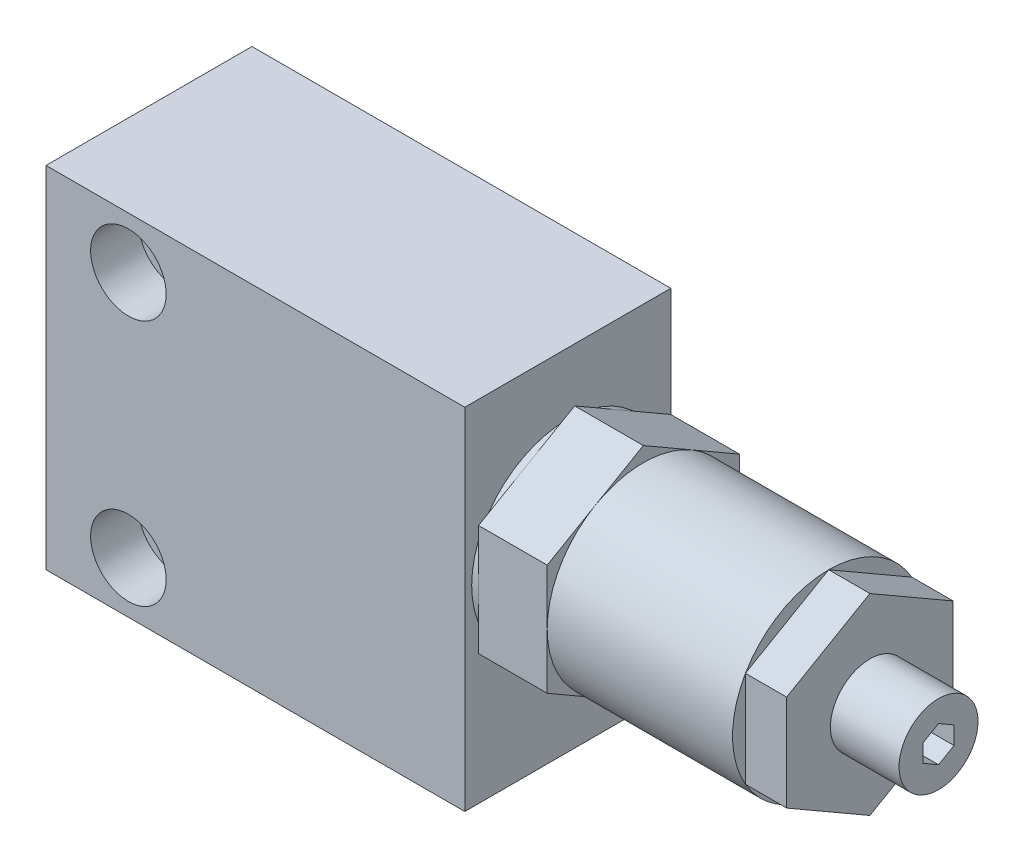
ISO-10303-21;
HEADER;
FILE_DESCRIPTION(('STEP AP214'),'2;1');
FILE_NAME('part.step','',(''),(''),'','','');
FILE_SCHEMA(('AUTOMOTIVE_DESIGN { 1 0 10303 214 1 1 1 1 }'));
ENDSEC;
DATA;
#1=APPLICATION_CONTEXT('core data for automotive mechanical design processes');
#2=APPLICATION_PROTOCOL_DEFINITION('international standard','automotive_design',2000,#1);
#3=PRODUCT_CONTEXT('',#1,'mechanical');
#4=PRODUCT('Part','Part','',(#3));
#5=PRODUCT_RELATED_PRODUCT_CATEGORY('part','',(#4));
#6=PRODUCT_DEFINITION_FORMATION('','',#4);
#7=PRODUCT_DEFINITION_CONTEXT('part definition',#1,'design');
#8=PRODUCT_DEFINITION('design','',#6,#7);
#9=PRODUCT_DEFINITION_SHAPE('','',#8);
#10=(LENGTH_UNIT() NAMED_UNIT(*) SI_UNIT(.MILLI.,.METRE.));
#11=(NAMED_UNIT(*) PLANE_ANGLE_UNIT() SI_UNIT($,.RADIAN.));
#12=(NAMED_UNIT(*) SI_UNIT($,.STERADIAN.) SOLID_ANGLE_UNIT());
#13=UNCERTAINTY_MEASURE_WITH_UNIT(LENGTH_MEASURE(1.E-05),#10,'distance_accuracy_value','');
#14=(GEOMETRIC_REPRESENTATION_CONTEXT(3) GLOBAL_UNCERTAINTY_ASSIGNED_CONTEXT((#13)) GLOBAL_UNIT_ASSIGNED_CONTEXT((#10,
#11,#12)) REPRESENTATION_CONTEXT('',''));
#15=CARTESIAN_POINT('',(0.,0.,0.));
#16=DIRECTION('',(0.,0.,1.));
#17=DIRECTION('',(1.,0.,0.));
#18=AXIS2_PLACEMENT_3D('',#15,#16,#17);
#19=CARTESIAN_POINT('',(105.,-23.,15.));
#20=DIRECTION('',(1.,0.,0.));
#21=DIRECTION('',(0.,1.,0.));
#22=AXIS2_PLACEMENT_3D('',#19,#20,#21);
#23=PLANE('',#22);
#24=DIRECTION('',(0.,-0.5,-0.866025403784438));
#25=VECTOR('',#24,1.);
#26=CARTESIAN_POINT('',(105.,-46.8980284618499,-2.14388819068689));
#27=LINE('',#26,#25);
#28=CARTESIAN_POINT('',(105.,-30.,27.1243556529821));
#29=VERTEX_POINT('',#28);
#30=CARTESIAN_POINT('',(105.,-37.,15.));
#31=VERTEX_POINT('',#30);
#32=EDGE_CURVE('E398',#29,#31,#27,.T.);
#33=ORIENTED_EDGE('',*,*,#32,.T.);
#34=DIRECTION('',(0.,0.5,-0.866025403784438));
#35=VECTOR('',#34,1.);
#36=CARTESIAN_POINT('',(105.,-20.10197153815,-14.2682438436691));
#37=LINE('',#36,#35);
#38=CARTESIAN_POINT('',(105.,-30.,2.87564434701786));
#39=VERTEX_POINT('',#38);
#40=EDGE_CURVE('E350',#31,#39,#37,.T.);
#41=ORIENTED_EDGE('',*,*,#40,.T.);
#42=DIRECTION('',(0.,1.,0.));
#43=VECTOR('',#42,1.);
#44=CARTESIAN_POINT('',(105.,-23.,2.87564434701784));
#45=LINE('',#44,#43);
#46=CARTESIAN_POINT('',(105.,-16.,2.87564434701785));
#47=VERTEX_POINT('',#46);
#48=EDGE_CURVE('E354',#39,#47,#45,.T.);
#49=ORIENTED_EDGE('',*,*,#48,.T.);
#50=DIRECTION('',(0.,0.5,0.866025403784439));
#51=VECTOR('',#50,1.);
#52=CARTESIAN_POINT('',(105.,-25.8980284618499,-14.2682438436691));
#53=LINE('',#52,#51);
#54=CARTESIAN_POINT('',(105.,-8.99999999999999,15.));
#55=VERTEX_POINT('',#54);
#56=EDGE_CURVE('E368',#47,#55,#53,.T.);
#57=ORIENTED_EDGE('',*,*,#56,.T.);
#58=DIRECTION('',(0.,-0.5,0.866025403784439));
#59=VECTOR('',#58,1.);
#60=CARTESIAN_POINT('',(105.,0.898028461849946,-2.14388819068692));
#61=LINE('',#60,#59);
#62=CARTESIAN_POINT('',(105.,-16.,27.1243556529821));
#63=VERTEX_POINT('',#62);
#64=EDGE_CURVE('E378',#55,#63,#61,.T.);
#65=ORIENTED_EDGE('',*,*,#64,.T.);
#66=DIRECTION('',(0.,-1.,0.));
#67=VECTOR('',#66,1.);
#68=CARTESIAN_POINT('',(105.,-23.,27.1243556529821));
#69=LINE('',#68,#67);
#70=EDGE_CURVE('E388',#63,#29,#69,.T.);
#71=ORIENTED_EDGE('',*,*,#70,.T.);
#72=EDGE_LOOP('',(#33,#41,#49,#57,#65,#71));
#73=FACE_BOUND('',#72,.T.);
#74=CARTESIAN_POINT('',(105.,-23.,15.));
#75=DIRECTION('',(1.,0.,0.));
#76=DIRECTION('',(0.,1.,0.));
#77=AXIS2_PLACEMENT_3D('',#74,#75,#76);
#78=CIRCLE('',#77,5.75);
#79=CARTESIAN_POINT('',(105.,-17.25,15.));
#80=VERTEX_POINT('',#79);
#81=EDGE_CURVE('E273',#80,#80,#78,.T.);
#82=ORIENTED_EDGE('',*,*,#81,.F.);
#83=EDGE_LOOP('',(#82));
#84=FACE_BOUND('',#83,.T.);
#85=ADVANCED_FACE('F34',(#73,#84),#23,.T.);
#86=CARTESIAN_POINT('',(105.,-23.,15.));
#87=DIRECTION('',(-1.,0.,0.));
#88=DIRECTION('',(0.,-1.,0.));
#89=AXIS2_PLACEMENT_3D('',#86,#87,#88);
#90=CYLINDRICAL_SURFACE('',#89,14.);
#91=CARTESIAN_POINT('',(61.,-23.,15.));
#92=DIRECTION('',(-1.,0.,0.));
#93=DIRECTION('',(0.,-1.,0.));
#94=AXIS2_PLACEMENT_3D('',#91,#92,#93);
#95=CIRCLE('',#94,14.);
#96=CARTESIAN_POINT('',(61.,-37.,15.));
#97=VERTEX_POINT('',#96);
#98=EDGE_CURVE('E467',#97,#97,#95,.F.);
#99=ORIENTED_EDGE('',*,*,#98,.T.);
#100=EDGE_LOOP('',(#99));
#101=FACE_BOUND('',#100,.T.);
#102=CARTESIAN_POINT('',(62.,-23.,15.));
#103=DIRECTION('',(1.,0.,0.));
#104=DIRECTION('',(0.,0.,-1.));
#105=AXIS2_PLACEMENT_3D('',#102,#103,#104);
#106=CIRCLE('',#105,14.);
#107=CARTESIAN_POINT('',(62.,-23.,0.999999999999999));
#108=VERTEX_POINT('',#107);
#109=CARTESIAN_POINT('',(62.,-10.8756443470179,8.));
#110=VERTEX_POINT('',#109);
#111=EDGE_CURVE('E682',#108,#110,#106,.T.);
#112=ORIENTED_EDGE('',*,*,#111,.F.);
#113=CARTESIAN_POINT('',(62.,-35.1243556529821,7.99999999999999));
#114=VERTEX_POINT('',#113);
#115=EDGE_CURVE('E678',#114,#108,#106,.T.);
#116=ORIENTED_EDGE('',*,*,#115,.F.);
#117=CARTESIAN_POINT('',(62.,-35.1243556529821,22.));
#118=VERTEX_POINT('',#117);
#119=EDGE_CURVE('E681',#118,#114,#106,.T.);
#120=ORIENTED_EDGE('',*,*,#119,.F.);
#121=CARTESIAN_POINT('',(62.,-23.,29.));
#122=VERTEX_POINT('',#121);
#123=EDGE_CURVE('E688',#122,#118,#106,.T.);
#124=ORIENTED_EDGE('',*,*,#123,.F.);
#125=CARTESIAN_POINT('',(62.,-10.8756443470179,22.));
#126=VERTEX_POINT('',#125);
#127=EDGE_CURVE('E696',#126,#122,#106,.T.);
#128=ORIENTED_EDGE('',*,*,#127,.F.);
#129=EDGE_CURVE('E690',#110,#126,#106,.T.);
#130=ORIENTED_EDGE('',*,*,#129,.F.);
#131=EDGE_LOOP('',(#112,#116,#120,#124,#128,#130));
#132=FACE_BOUND('',#131,.T.);
#133=ADVANCED_FACE('F609',(#101,#132),#90,.T.);
#134=CARTESIAN_POINT('',(0.,-23.,15.));
#135=DIRECTION('',(-1.,0.,0.));
#136=DIRECTION('',(0.,0.,1.));
#137=AXIS2_PLACEMENT_3D('',#134,#135,#136);
#138=CYLINDRICAL_SURFACE('',#137,5.7225);
#139=CARTESIAN_POINT('',(19.01,-23.,15.));
#140=DIRECTION('',(-1.,0.,0.));
#141=DIRECTION('',(0.,0.,1.));
#142=AXIS2_PLACEMENT_3D('',#139,#140,#141);
#143=CIRCLE('',#142,5.72249999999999);
#144=CARTESIAN_POINT('',(19.01,-23.,20.7225));
#145=VERTEX_POINT('',#144);
#146=EDGE_CURVE('E1231',#145,#145,#143,.T.);
#147=ORIENTED_EDGE('',*,*,#146,.F.);
#148=EDGE_LOOP('',(#147));
#149=FACE_BOUND('',#148,.T.);
#150=CARTESIAN_POINT('',(10.5,-23.,9.2775));
#151=CARTESIAN_POINT('',(10.5000020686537,-22.9172575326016,9.27750129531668));
#152=CARTESIAN_POINT('',(10.506869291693,-22.8344926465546,9.27931230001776));
#153=CARTESIAN_POINT('',(10.5341102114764,-22.6713437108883,9.28636099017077));
#154=CARTESIAN_POINT('',(10.5544907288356,-22.5909608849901,9.29160040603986));
#155=CARTESIAN_POINT('',(10.608052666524,-22.4349549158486,9.30492709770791));
#156=CARTESIAN_POINT('',(10.6412178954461,-22.3593258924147,9.31301077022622));
#157=CARTESIAN_POINT('',(10.719348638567,-22.2147039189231,9.33116983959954));
#158=CARTESIAN_POINT('',(10.7643148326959,-22.1457113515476,9.34124535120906));
#159=CARTESIAN_POINT('',(10.8658378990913,-22.0147705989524,9.36255173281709));
#160=CARTESIAN_POINT('',(10.922610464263,-21.9529927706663,9.37380182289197));
#161=CARTESIAN_POINT('',(11.0456734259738,-21.8397171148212,9.39606481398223));
#162=CARTESIAN_POINT('',(11.111965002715,-21.7882205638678,9.40707768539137));
#163=CARTESIAN_POINT('',(11.2535336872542,-21.6961468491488,9.42781512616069));
#164=CARTESIAN_POINT('',(11.3289411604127,-21.6557641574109,9.43751540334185));
#165=CARTESIAN_POINT('',(11.4857703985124,-21.5883165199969,9.45424739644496));
#166=CARTESIAN_POINT('',(11.5671910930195,-21.5612492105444,9.46127958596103));
#167=CARTESIAN_POINT('',(11.7318525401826,-21.5217894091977,9.47168100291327));
#168=CARTESIAN_POINT('',(11.8150144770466,-21.5090887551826,9.47512701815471));
#169=CARTESIAN_POINT('',(11.9823545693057,-21.4977622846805,9.47819545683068));
#170=CARTESIAN_POINT('',(12.0665325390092,-21.4991339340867,9.47781856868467));
#171=CARTESIAN_POINT('',(12.2311221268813,-21.5156681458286,9.47335259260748));
#172=CARTESIAN_POINT('',(12.3115741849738,-21.5304594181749,9.46936345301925));
#173=CARTESIAN_POINT('',(12.4688129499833,-21.5728190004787,9.4582822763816));
#174=CARTESIAN_POINT('',(12.5455993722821,-21.6003883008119,9.4511899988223));
#175=CARTESIAN_POINT('',(12.6943027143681,-21.6678277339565,9.43461271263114));
#176=CARTESIAN_POINT('',(12.7661570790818,-21.7078293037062,9.42510234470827));
#177=CARTESIAN_POINT('',(12.9022647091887,-21.7989060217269,9.40477427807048));
#178=CARTESIAN_POINT('',(12.9665165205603,-21.8499832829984,9.39395633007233));
#179=CARTESIAN_POINT('',(13.0877183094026,-21.9636668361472,9.37181463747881));
#180=CARTESIAN_POINT('',(13.1443748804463,-22.0265853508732,9.36048568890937));
#181=CARTESIAN_POINT('',(13.246391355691,-22.1611683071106,9.33890423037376));
#182=CARTESIAN_POINT('',(13.291750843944,-22.2328330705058,9.32865176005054));
#183=CARTESIAN_POINT('',(13.3700087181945,-22.3833186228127,9.31031884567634));
#184=CARTESIAN_POINT('',(13.4028555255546,-22.4621674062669,9.30224743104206));
#185=CARTESIAN_POINT('',(13.4547437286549,-22.6245273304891,9.28925141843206));
#186=CARTESIAN_POINT('',(13.4737880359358,-22.7080374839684,9.28432615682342));
#187=CARTESIAN_POINT('',(13.4970734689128,-22.8748443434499,9.27827715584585));
#188=CARTESIAN_POINT('',(13.5017136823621,-22.9580817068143,9.27705095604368));
#189=CARTESIAN_POINT('',(13.4971592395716,-23.1241447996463,9.27824442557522));
#190=CARTESIAN_POINT('',(13.487965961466,-23.2069705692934,9.28066373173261));
#191=CARTESIAN_POINT('',(13.4563333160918,-23.3684454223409,9.28881033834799));
#192=CARTESIAN_POINT('',(13.4341151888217,-23.4471408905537,9.29448235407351));
#193=CARTESIAN_POINT('',(13.3773192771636,-23.599681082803,9.30849221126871));
#194=CARTESIAN_POINT('',(13.3427401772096,-23.6735252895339,9.31683033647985));
#195=CARTESIAN_POINT('',(13.2614544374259,-23.8158278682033,9.3354890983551));
#196=CARTESIAN_POINT('',(13.2145288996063,-23.8841565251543,9.34584454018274));
#197=CARTESIAN_POINT('',(13.1101587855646,-24.0121101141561,9.36734023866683));
#198=CARTESIAN_POINT('',(13.0527122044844,-24.0717333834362,9.37848064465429));
#199=CARTESIAN_POINT('',(12.9270707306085,-24.182255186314,9.40066541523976));
#200=CARTESIAN_POINT('',(12.8586261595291,-24.2328725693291,9.41169894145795));
#201=CARTESIAN_POINT('',(12.7139826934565,-24.3219075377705,9.43208648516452));
#202=CARTESIAN_POINT('',(12.6377841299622,-24.3603256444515,9.44144057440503));
#203=CARTESIAN_POINT('',(12.4801857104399,-24.4235823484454,9.45730358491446));
#204=CARTESIAN_POINT('',(12.398819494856,-24.4485003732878,9.46382910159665));
#205=CARTESIAN_POINT('',(12.2328527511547,-24.4842441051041,9.47330350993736));
#206=CARTESIAN_POINT('',(12.1482530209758,-24.4950732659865,9.47625327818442));
#207=CARTESIAN_POINT('',(11.9810941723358,-24.5021381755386,9.47817074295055));
#208=CARTESIAN_POINT('',(11.8985552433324,-24.4988250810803,9.4772615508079));
#209=CARTESIAN_POINT('',(11.7352572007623,-24.4787421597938,9.47185077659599));
#210=CARTESIAN_POINT('',(11.6544980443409,-24.4619726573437,9.46734928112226));
#211=CARTESIAN_POINT('',(11.4975982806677,-24.4157103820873,9.45533310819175));
#212=CARTESIAN_POINT('',(11.4214285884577,-24.3863101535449,9.44784037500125));
#213=CARTESIAN_POINT('',(11.2750461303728,-24.3156931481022,9.43068476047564));
#214=CARTESIAN_POINT('',(11.2048342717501,-24.2744745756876,9.42102154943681));
#215=CARTESIAN_POINT('',(11.070199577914,-24.1800105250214,9.40026969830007));
#216=CARTESIAN_POINT('',(11.0059987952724,-24.1264557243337,9.3891482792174));
#217=CARTESIAN_POINT('',(10.8873487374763,-24.0094317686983,9.36691959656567));
#218=CARTESIAN_POINT('',(10.8329018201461,-23.9459602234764,9.35581233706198));
#219=CARTESIAN_POINT('',(10.7342125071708,-23.8093375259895,9.33459189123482));
#220=CARTESIAN_POINT('',(10.6902016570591,-23.7360149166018,9.32450368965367));
#221=CARTESIAN_POINT('',(10.6152006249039,-23.58275085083,9.30672848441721));
#222=CARTESIAN_POINT('',(10.5842018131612,-23.5028138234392,9.29903989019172));
#223=CARTESIAN_POINT('',(10.5403046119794,-23.352607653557,9.28796441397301));
#224=CARTESIAN_POINT('',(10.5252247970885,-23.2830056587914,9.28406839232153));
#225=CARTESIAN_POINT('',(10.5050720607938,-23.1422745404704,9.27883574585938));
#226=CARTESIAN_POINT('',(10.4999982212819,-23.0711455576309,9.2774988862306));
#227=CARTESIAN_POINT('',(10.5,-23.,9.2775));
#228=B_SPLINE_CURVE_WITH_KNOTS('',3,(#150,#151,#152,#153,#154,#155,#156,#157,#158,#159,#160,
#161,#162,#163,#164,#165,#166,#167,#168,#169,#170,#171,#172,#173,#174,#175,#176,#177,#178,#179,
#180,#181,#182,#183,#184,#185,#186,#187,#188,#189,#190,#191,#192,#193,#194,#195,#196,#197,#198,
#199,#200,#201,#202,#203,#204,#205,#206,#207,#208,#209,#210,#211,#212,#213,#214,#215,#216,#217,
#218,#219,#220,#221,#222,#223,#224,#225,#226,#227),.UNSPECIFIED.,.T.,.F.,(4,2,2,2,2,2,2,2,2,2,2,
2,2,2,2,2,2,2,2,2,2,2,2,2,2,2,2,2,2,2,2,2,2,2,2,2,2,2,4),(0.,0.247966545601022,
0.496058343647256,0.743836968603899,0.991629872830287,1.24442589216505,1.49725328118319,
1.75425797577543,2.01121702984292,2.262553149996,2.51384401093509,2.75838743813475,
3.00294982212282,3.25019117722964,3.49747974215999,3.75255015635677,4.00762996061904,
4.2637501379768,4.51981627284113,4.7687213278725,5.01760158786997,5.26237207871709,
5.50716862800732,5.75663800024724,6.00615496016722,6.26245307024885,6.51874022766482,
6.77350268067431,7.02820266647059,7.27483914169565,7.52146967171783,7.76632318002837,
8.01121390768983,8.26308491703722,8.51501672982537,8.77210243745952,9.0290173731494,
9.24224931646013,9.45546169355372),.UNSPECIFIED.);
#229=CARTESIAN_POINT('',(10.5,-23.,9.2775));
#230=VERTEX_POINT('',#229);
#231=EDGE_CURVE('E433',#230,#230,#228,.T.);
#232=ORIENTED_EDGE('',*,*,#231,.T.);
#233=EDGE_LOOP('',(#232));
#234=FACE_BOUND('',#233,.T.);
#235=CARTESIAN_POINT('',(1.5,-23.,15.));
#236=DIRECTION('',(-1.,0.,0.));
#237=DIRECTION('',(0.,-1.,0.));
#238=AXIS2_PLACEMENT_3D('',#235,#236,#237);
#239=CIRCLE('',#238,5.7225);
#240=CARTESIAN_POINT('',(1.5,-28.7225,15.));
#241=VERTEX_POINT('',#240);
#242=EDGE_CURVE('E416',#241,#241,#239,.F.);
#243=ORIENTED_EDGE('',*,*,#242,.F.);
#244=EDGE_LOOP('',(#243));
#245=FACE_BOUND('',#244,.T.);
#246=ADVANCED_FACE('F442',(#149,#234,#245),#138,.F.);
#247=CARTESIAN_POINT('',(35.5,-51.,15.));
#248=DIRECTION('',(0.,-1.,0.));
#249=DIRECTION('',(0.,0.,-1.));
#250=AXIS2_PLACEMENT_3D('',#247,#248,#249);
#251=CYLINDRICAL_SURFACE('',#250,5.72249999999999);
#252=CARTESIAN_POINT('',(34.,-39.,9.47759053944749));
#253=CARTESIAN_POINT('',(34.0000020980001,-39.0826873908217,9.47758905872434));
#254=CARTESIAN_POINT('',(34.0068604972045,-39.1653972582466,9.47571311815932));
#255=CARTESIAN_POINT('',(34.0340631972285,-39.3284320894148,9.46843357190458));
#256=CARTESIAN_POINT('',(34.0544145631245,-39.4087557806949,9.46302811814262));
#257=CARTESIAN_POINT('',(34.1078913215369,-39.5646362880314,9.44934286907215));
#258=CARTESIAN_POINT('',(34.1409991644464,-39.6401994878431,9.44106702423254));
#259=CARTESIAN_POINT('',(34.2189945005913,-39.7847098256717,9.42257847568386));
#260=CARTESIAN_POINT('',(34.2638827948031,-39.8536565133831,9.41236564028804));
#261=CARTESIAN_POINT('',(34.3653247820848,-39.9846433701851,9.39087727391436));
#262=CARTESIAN_POINT('',(34.4221117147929,-40.0464999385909,9.37958341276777));
#263=CARTESIAN_POINT('',(34.5452371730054,-40.1599291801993,9.35736396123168));
#264=CARTESIAN_POINT('',(34.6115766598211,-40.2115008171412,9.34643840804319));
#265=CARTESIAN_POINT('',(34.7531929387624,-40.3036578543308,9.32598252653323));
#266=CARTESIAN_POINT('',(34.828591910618,-40.3440613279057,9.31647634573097));
#267=CARTESIAN_POINT('',(34.9854030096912,-40.4115496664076,9.30014028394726));
#268=CARTESIAN_POINT('',(35.0668141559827,-40.4386366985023,9.29330996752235));
#269=CARTESIAN_POINT('',(35.231422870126,-40.4781307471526,9.28322482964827));
#270=CARTESIAN_POINT('',(35.3145408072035,-40.490849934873,9.27989408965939));
#271=CARTESIAN_POINT('',(35.4817930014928,-40.5022287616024,9.27691819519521));
#272=CARTESIAN_POINT('',(35.5659270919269,-40.5008906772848,9.27727244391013));
#273=CARTESIAN_POINT('',(35.7306526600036,-40.4844140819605,9.28157073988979));
#274=CARTESIAN_POINT('',(35.8112805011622,-40.4696127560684,9.28542707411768));
#275=CARTESIAN_POINT('',(35.9688654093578,-40.4271738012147,9.29619312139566));
#276=CARTESIAN_POINT('',(36.045822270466,-40.3995354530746,9.30310300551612));
#277=CARTESIAN_POINT('',(36.1947491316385,-40.3319445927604,9.31933098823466));
#278=CARTESIAN_POINT('',(36.2666635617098,-40.2918753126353,9.32867178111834));
#279=CARTESIAN_POINT('',(36.402863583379,-40.2006493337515,9.34875324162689));
#280=CARTESIAN_POINT('',(36.4671477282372,-40.1494905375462,9.35949417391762));
#281=CARTESIAN_POINT('',(36.5882745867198,-40.0357428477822,9.38158635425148));
#282=CARTESIAN_POINT('',(36.6448397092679,-39.9728596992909,9.39294625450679));
#283=CARTESIAN_POINT('',(36.7466877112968,-39.8383820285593,9.41470718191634));
#284=CARTESIAN_POINT('',(36.7919699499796,-39.7667870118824,9.42510815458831));
#285=CARTESIAN_POINT('',(36.8701686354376,-39.616332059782,9.44380729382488));
#286=CARTESIAN_POINT('',(36.9030120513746,-39.5374325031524,9.45209295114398));
#287=CARTESIAN_POINT('',(36.9548785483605,-39.3749606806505,9.46546659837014));
#288=CARTESIAN_POINT('',(36.9739049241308,-39.2913895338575,9.47055535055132));
#289=CARTESIAN_POINT('',(36.9971237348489,-39.1245368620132,9.47679728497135));
#290=CARTESIAN_POINT('',(37.001729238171,-39.0413168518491,9.47806002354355));
#291=CARTESIAN_POINT('',(36.9971116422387,-38.8752962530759,9.47680627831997));
#292=CARTESIAN_POINT('',(36.9878899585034,-38.7924956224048,9.47429018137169));
#293=CARTESIAN_POINT('',(36.9562433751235,-38.6312395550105,9.46586785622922));
#294=CARTESIAN_POINT('',(36.9340645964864,-38.5527321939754,9.46002487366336));
#295=CARTESIAN_POINT('',(36.8774090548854,-38.4005510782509,9.44566843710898));
#296=CARTESIAN_POINT('',(36.8429307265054,-38.3268779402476,9.43715464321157));
#297=CARTESIAN_POINT('',(36.7618089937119,-38.1847222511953,9.41818939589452));
#298=CARTESIAN_POINT('',(36.714921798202,-38.1163839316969,9.40770048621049));
#299=CARTESIAN_POINT('',(36.6106171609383,-37.9883935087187,9.3860560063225));
#300=CARTESIAN_POINT('',(36.5531978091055,-37.9287429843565,9.37490031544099));
#301=CARTESIAN_POINT('',(36.4275522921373,-37.8181182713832,9.35280370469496));
#302=CARTESIAN_POINT('',(36.3590699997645,-37.7674315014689,9.34187738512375));
#303=CARTESIAN_POINT('',(36.214328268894,-37.6782744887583,9.32178974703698));
#304=CARTESIAN_POINT('',(36.1380692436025,-37.6398035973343,9.31262833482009));
#305=CARTESIAN_POINT('',(35.9804743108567,-37.5765188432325,9.29716158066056));
#306=CARTESIAN_POINT('',(35.8991811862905,-37.5516038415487,9.29083515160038));
#307=CARTESIAN_POINT('',(35.7333721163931,-37.5158415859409,9.28165850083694));
#308=CARTESIAN_POINT('',(35.6488568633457,-37.5049913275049,9.27880753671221));
#309=CARTESIAN_POINT('',(35.4816918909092,-37.4978494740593,9.27693677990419));
#310=CARTESIAN_POINT('',(35.3990611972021,-37.5011355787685,9.27780585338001));
#311=CARTESIAN_POINT('',(35.2355722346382,-37.5211963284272,9.28302755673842));
#312=CARTESIAN_POINT('',(35.1547139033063,-37.5379704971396,9.2873800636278));
#313=CARTESIAN_POINT('',(34.9975546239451,-37.5842957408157,9.2990588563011));
#314=CARTESIAN_POINT('',(34.9212276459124,-37.6137637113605,9.30636578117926));
#315=CARTESIAN_POINT('',(34.7745577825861,-37.6845656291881,9.32318790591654));
#316=CARTESIAN_POINT('',(34.7042157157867,-37.7259011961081,9.33270340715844));
#317=CARTESIAN_POINT('',(34.569536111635,-37.8205153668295,9.3532303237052));
#318=CARTESIAN_POINT('',(34.5054015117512,-37.8740758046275,9.36427412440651));
#319=CARTESIAN_POINT('',(34.386887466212,-37.9910812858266,9.38647793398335));
#320=CARTESIAN_POINT('',(34.3325105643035,-38.0545288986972,9.3976379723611));
#321=CARTESIAN_POINT('',(34.2339250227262,-38.191114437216,9.41908028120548));
#322=CARTESIAN_POINT('',(34.1899544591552,-38.2644281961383,9.42933913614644));
#323=CARTESIAN_POINT('',(34.1150265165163,-38.4176672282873,9.44749146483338));
#324=CARTESIAN_POINT('',(34.0840603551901,-38.49758799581,9.45538653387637));
#325=CARTESIAN_POINT('',(34.0402302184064,-38.6477155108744,9.46678246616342));
#326=CARTESIAN_POINT('',(34.0251785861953,-38.7172518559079,9.47080335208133));
#327=CARTESIAN_POINT('',(34.0050631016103,-38.8578533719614,9.47620788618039));
#328=CARTESIAN_POINT('',(33.9999981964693,-38.9289183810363,9.47759181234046));
#329=CARTESIAN_POINT('',(34.,-39.,9.47759053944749));
#330=B_SPLINE_CURVE_WITH_KNOTS('',3,(#252,#253,#254,#255,#256,#257,#258,#259,#260,#261,#262,
#263,#264,#265,#266,#267,#268,#269,#270,#271,#272,#273,#274,#275,#276,#277,#278,#279,#280,#281,
#282,#283,#284,#285,#286,#287,#288,#289,#290,#291,#292,#293,#294,#295,#296,#297,#298,#299,#300,
#301,#302,#303,#304,#305,#306,#307,#308,#309,#310,#311,#312,#313,#314,#315,#316,#317,#318,#319,
#320,#321,#322,#323,#324,#325,#326,#327,#328,#329),.UNSPECIFIED.,.T.,.F.,(4,2,2,2,2,2,2,2,2,2,2,
2,2,2,2,2,2,2,2,2,2,2,2,2,2,2,2,2,2,2,2,2,2,2,2,2,2,2,4),(0.,0.24780089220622,0.495731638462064,
0.743322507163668,0.990930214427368,1.24394257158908,1.49698040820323,1.75392524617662,
2.0108282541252,2.26203517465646,2.51320141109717,2.75824538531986,3.00330308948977,
3.25073621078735,3.49821617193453,3.75304356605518,4.00788542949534,4.26420114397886,
4.52045571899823,4.76929971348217,5.01811823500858,5.26235739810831,5.5066276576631,
5.75610812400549,6.00563388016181,6.26209887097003,6.51855024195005,6.77306106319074,
7.02751750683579,7.27442612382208,7.52132602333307,7.76663350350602,8.01197447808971,
8.26367573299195,8.51544250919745,8.77250775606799,9.0293991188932,9.24244182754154,
9.45546207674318),.UNSPECIFIED.);
#331=CARTESIAN_POINT('',(34.,-39.,9.47759053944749));
#332=VERTEX_POINT('',#331);
#333=EDGE_CURVE('E429',#332,#332,#330,.T.);
#334=ORIENTED_EDGE('',*,*,#333,.F.);
#335=EDGE_LOOP('',(#334));
#336=FACE_BOUND('',#335,.T.);
#337=CARTESIAN_POINT('',(35.5,-31.99,15.));
#338=DIRECTION('',(0.,-1.,0.));
#339=DIRECTION('',(0.,0.,-1.));
#340=AXIS2_PLACEMENT_3D('',#337,#338,#339);
#341=CIRCLE('',#340,5.72249999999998);
#342=CARTESIAN_POINT('',(35.5,-31.99,9.27750000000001));
#343=VERTEX_POINT('',#342);
#344=EDGE_CURVE('E426',#343,#343,#341,.T.);
#345=ORIENTED_EDGE('',*,*,#344,.F.);
#346=EDGE_LOOP('',(#345));
#347=FACE_BOUND('',#346,.T.);
#348=CARTESIAN_POINT('',(35.5,-49.5,15.));
#349=DIRECTION('',(0.,-1.,0.));
#350=DIRECTION('',(0.,0.,-1.));
#351=AXIS2_PLACEMENT_3D('',#348,#349,#350);
#352=CIRCLE('',#351,5.72249999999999);
#353=CARTESIAN_POINT('',(35.5,-49.5,9.27750000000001));
#354=VERTEX_POINT('',#353);
#355=EDGE_CURVE('E422',#354,#354,#352,.F.);
#356=ORIENTED_EDGE('',*,*,#355,.F.);
#357=EDGE_LOOP('',(#356));
#358=FACE_BOUND('',#357,.T.);
#359=ADVANCED_FACE('F470',(#336,#347,#358),#251,.F.);
#360=CARTESIAN_POINT('',(61.,0.,30.));
#361=DIRECTION('',(-1.,0.,0.));
#362=DIRECTION('',(0.,-1.,0.));
#363=AXIS2_PLACEMENT_3D('',#360,#361,#362);
#364=PLANE('',#363);
#365=DIRECTION('',(0.,1.,0.));
#366=VECTOR('',#365,1.);
#367=CARTESIAN_POINT('',(61.,0.,0.));
#368=LINE('',#367,#366);
#369=CARTESIAN_POINT('',(61.,-51.,0.));
#370=VERTEX_POINT('',#369);
#371=CARTESIAN_POINT('',(61.,0.,0.));
#372=VERTEX_POINT('',#371);
#373=EDGE_CURVE('E657',#370,#372,#368,.T.);
#374=ORIENTED_EDGE('',*,*,#373,.T.);
#375=DIRECTION('',(0.,0.,-1.));
#376=VECTOR('',#375,1.);
#377=CARTESIAN_POINT('',(61.,0.,30.));
#378=LINE('',#377,#376);
#379=CARTESIAN_POINT('',(61.,0.,30.));
#380=VERTEX_POINT('',#379);
#381=EDGE_CURVE('E664',#380,#372,#378,.T.);
#382=ORIENTED_EDGE('',*,*,#381,.F.);
#383=DIRECTION('',(0.,1.,0.));
#384=VECTOR('',#383,1.);
#385=CARTESIAN_POINT('',(61.,0.,30.));
#386=LINE('',#385,#384);
#387=CARTESIAN_POINT('',(61.,-51.,30.));
#388=VERTEX_POINT('',#387);
#389=EDGE_CURVE('E663',#388,#380,#386,.T.);
#390=ORIENTED_EDGE('',*,*,#389,.F.);
#391=DIRECTION('',(0.,0.,-1.));
#392=VECTOR('',#391,1.);
#393=CARTESIAN_POINT('',(61.,-51.,30.));
#394=LINE('',#393,#392);
#395=EDGE_CURVE('E649',#388,#370,#394,.T.);
#396=ORIENTED_EDGE('',*,*,#395,.T.);
#397=EDGE_LOOP('',(#374,#382,#390,#396));
#398=FACE_BOUND('',#397,.T.);
#399=ORIENTED_EDGE('',*,*,#98,.F.);
#400=EDGE_LOOP('',(#399));
#401=FACE_BOUND('',#400,.T.);
#402=ADVANCED_FACE('F474',(#398,#401),#364,.F.);
#403=CARTESIAN_POINT('',(0.,0.,30.));
#404=DIRECTION('',(1.,0.,0.));
#405=DIRECTION('',(0.,1.,0.));
#406=AXIS2_PLACEMENT_3D('',#403,#404,#405);
#407=PLANE('',#406);
#408=CARTESIAN_POINT('',(0.,-23.,15.));
#409=DIRECTION('',(-1.,0.,0.));
#410=DIRECTION('',(0.,-1.,0.));
#411=AXIS2_PLACEMENT_3D('',#408,#409,#410);
#412=CIRCLE('',#411,7.);
#413=CARTESIAN_POINT('',(0.,-30.,15.));
#414=VERTEX_POINT('',#413);
#415=EDGE_CURVE('E411',#414,#414,#412,.T.);
#416=ORIENTED_EDGE('',*,*,#415,.F.);
#417=EDGE_LOOP('',(#416));
#418=FACE_BOUND('',#417,.T.);
#419=DIRECTION('',(0.,-1.,0.));
#420=VECTOR('',#419,1.);
#421=CARTESIAN_POINT('',(0.,0.,0.));
#422=LINE('',#421,#420);
#423=CARTESIAN_POINT('',(0.,0.,0.));
#424=VERTEX_POINT('',#423);
#425=CARTESIAN_POINT('',(0.,-51.,0.));
#426=VERTEX_POINT('',#425);
#427=EDGE_CURVE('E658',#424,#426,#422,.T.);
#428=ORIENTED_EDGE('',*,*,#427,.T.);
#429=DIRECTION('',(0.,0.,-1.));
#430=VECTOR('',#429,1.);
#431=CARTESIAN_POINT('',(0.,-51.,30.));
#432=LINE('',#431,#430);
#433=CARTESIAN_POINT('',(0.,-51.,30.));
#434=VERTEX_POINT('',#433);
#435=EDGE_CURVE('E652',#434,#426,#432,.T.);
#436=ORIENTED_EDGE('',*,*,#435,.F.);
#437=DIRECTION('',(0.,-1.,0.));
#438=VECTOR('',#437,1.);
#439=CARTESIAN_POINT('',(0.,0.,30.));
#440=LINE('',#439,#438);
#441=CARTESIAN_POINT('',(0.,0.,30.));
#442=VERTEX_POINT('',#441);
#443=EDGE_CURVE('E669',#442,#434,#440,.T.);
#444=ORIENTED_EDGE('',*,*,#443,.F.);
#445=DIRECTION('',(0.,0.,-1.));
#446=VECTOR('',#445,1.);
#447=CARTESIAN_POINT('',(0.,0.,30.));
#448=LINE('',#447,#446);
#449=EDGE_CURVE('E673',#442,#424,#448,.T.);
#450=ORIENTED_EDGE('',*,*,#449,.T.);
#451=EDGE_LOOP('',(#428,#436,#444,#450));
#452=FACE_BOUND('',#451,.T.);
#453=ADVANCED_FACE('F36',(#418,#452),#407,.F.);
#454=CARTESIAN_POINT('',(0.,-51.,30.));
#455=DIRECTION('',(0.,1.,0.));
#456=DIRECTION('',(0.,0.,1.));
#457=AXIS2_PLACEMENT_3D('',#454,#455,#456);
#458=PLANE('',#457);
#459=CARTESIAN_POINT('',(35.5,-51.,15.));
#460=DIRECTION('',(0.,-1.,0.));
#461=DIRECTION('',(0.,0.,-1.));
#462=AXIS2_PLACEMENT_3D('',#459,#460,#461);
#463=CIRCLE('',#462,7.);
#464=CARTESIAN_POINT('',(35.5,-51.,8.));
#465=VERTEX_POINT('',#464);
#466=EDGE_CURVE('E423',#465,#465,#463,.T.);
#467=ORIENTED_EDGE('',*,*,#466,.F.);
#468=EDGE_LOOP('',(#467));
#469=FACE_BOUND('',#468,.T.);
#470=DIRECTION('',(1.,0.,0.));
#471=VECTOR('',#470,1.);
#472=CARTESIAN_POINT('',(0.,-51.,0.));
#473=LINE('',#472,#471);
#474=EDGE_CURVE('E647',#426,#370,#473,.T.);
#475=ORIENTED_EDGE('',*,*,#474,.T.);
#476=ORIENTED_EDGE('',*,*,#395,.F.);
#477=DIRECTION('',(1.,0.,0.));
#478=VECTOR('',#477,1.);
#479=CARTESIAN_POINT('',(0.,-51.,30.));
#480=LINE('',#479,#478);
#481=EDGE_CURVE('E1248',#434,#388,#480,.T.);
#482=ORIENTED_EDGE('',*,*,#481,.F.);
#483=ORIENTED_EDGE('',*,*,#435,.T.);
#484=EDGE_LOOP('',(#475,#476,#482,#483));
#485=FACE_BOUND('',#484,.T.);
#486=ADVANCED_FACE('F633',(#469,#485),#458,.F.);
#487=CARTESIAN_POINT('',(0.,0.,30.));
#488=DIRECTION('',(0.,-1.,0.));
#489=DIRECTION('',(0.,0.,-1.));
#490=AXIS2_PLACEMENT_3D('',#487,#488,#489);
#491=PLANE('',#490);
#492=DIRECTION('',(-1.,0.,0.));
#493=VECTOR('',#492,1.);
#494=CARTESIAN_POINT('',(0.,0.,0.));
#495=LINE('',#494,#493);
#496=EDGE_CURVE('E667',#372,#424,#495,.T.);
#497=ORIENTED_EDGE('',*,*,#496,.T.);
#498=ORIENTED_EDGE('',*,*,#449,.F.);
#499=DIRECTION('',(-1.,0.,0.));
#500=VECTOR('',#499,1.);
#501=CARTESIAN_POINT('',(0.,0.,30.));
#502=LINE('',#501,#500);
#503=EDGE_CURVE('E676',#380,#442,#502,.T.);
#504=ORIENTED_EDGE('',*,*,#503,.F.);
#505=ORIENTED_EDGE('',*,*,#381,.T.);
#506=EDGE_LOOP('',(#497,#498,#504,#505));
#507=FACE_BOUND('',#506,.T.);
#508=ADVANCED_FACE('F626',(#507),#491,.F.);
#509=CARTESIAN_POINT('',(0.,-51.,30.));
#510=DIRECTION('',(0.,0.,1.));
#511=DIRECTION('',(1.,0.,0.));
#512=AXIS2_PLACEMENT_3D('',#509,#510,#511);
#513=PLANE('',#512);
#514=CARTESIAN_POINT('',(12.,-43.5,30.));
#515=DIRECTION('',(0.,0.,1.));
#516=DIRECTION('',(1.,0.,0.));
#517=AXIS2_PLACEMENT_3D('',#514,#515,#516);
#518=CIRCLE('',#517,5.49999999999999);
#519=CARTESIAN_POINT('',(17.5,-43.5,30.));
#520=VERTEX_POINT('',#519);
#521=EDGE_CURVE('E1273',#520,#520,#518,.T.);
#522=ORIENTED_EDGE('',*,*,#521,.F.);
#523=EDGE_LOOP('',(#522));
#524=FACE_BOUND('',#523,.T.);
#525=CARTESIAN_POINT('',(12.,-7.5,30.));
#526=DIRECTION('',(0.,0.,1.));
#527=DIRECTION('',(1.,0.,0.));
#528=AXIS2_PLACEMENT_3D('',#525,#526,#527);
#529=CIRCLE('',#528,5.49999999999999);
#530=CARTESIAN_POINT('',(17.5,-7.5,30.));
#531=VERTEX_POINT('',#530);
#532=EDGE_CURVE('E1261',#531,#531,#529,.T.);
#533=ORIENTED_EDGE('',*,*,#532,.F.);
#534=EDGE_LOOP('',(#533));
#535=FACE_BOUND('',#534,.T.);
#536=ORIENTED_EDGE('',*,*,#443,.T.);
#537=ORIENTED_EDGE('',*,*,#481,.T.);
#538=ORIENTED_EDGE('',*,*,#389,.T.);
#539=ORIENTED_EDGE('',*,*,#503,.T.);
#540=EDGE_LOOP('',(#536,#537,#538,#539));
#541=FACE_BOUND('',#540,.T.);
#542=ADVANCED_FACE('F622',(#524,#535,#541),#513,.T.);
#543=CARTESIAN_POINT('',(0.,-51.,0.));
#544=DIRECTION('',(0.,0.,1.));
#545=DIRECTION('',(1.,0.,0.));
#546=AXIS2_PLACEMENT_3D('',#543,#544,#545);
#547=PLANE('',#546);
#548=CARTESIAN_POINT('',(12.,-23.,0.));
#549=DIRECTION('',(0.,0.,-1.));
#550=DIRECTION('',(-1.,0.,0.));
#551=AXIS2_PLACEMENT_3D('',#548,#549,#550);
#552=CIRCLE('',#551,6.);
#553=CARTESIAN_POINT('',(6.,-23.,0.));
#554=VERTEX_POINT('',#553);
#555=EDGE_CURVE('E1283',#554,#554,#552,.T.);
#556=ORIENTED_EDGE('',*,*,#555,.F.);
#557=EDGE_LOOP('',(#556));
#558=FACE_BOUND('',#557,.T.);
#559=CARTESIAN_POINT('',(35.5,-39.,0.));
#560=DIRECTION('',(0.,0.,-1.));
#561=DIRECTION('',(-1.,0.,0.));
#562=AXIS2_PLACEMENT_3D('',#559,#560,#561);
#563=CIRCLE('',#562,6.);
#564=CARTESIAN_POINT('',(29.5,-39.,0.));
#565=VERTEX_POINT('',#564);
#566=EDGE_CURVE('E1277',#565,#565,#563,.T.);
#567=ORIENTED_EDGE('',*,*,#566,.F.);
#568=EDGE_LOOP('',(#567));
#569=FACE_BOUND('',#568,.T.);
#570=CARTESIAN_POINT('',(12.,-43.5,0.));
#571=DIRECTION('',(0.,0.,1.));
#572=DIRECTION('',(1.,0.,0.));
#573=AXIS2_PLACEMENT_3D('',#570,#571,#572);
#574=CIRCLE('',#573,3.29999999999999);
#575=CARTESIAN_POINT('',(15.3,-43.5,0.));
#576=VERTEX_POINT('',#575);
#577=EDGE_CURVE('E1264',#576,#576,#574,.T.);
#578=ORIENTED_EDGE('',*,*,#577,.T.);
#579=EDGE_LOOP('',(#578));
#580=FACE_BOUND('',#579,.T.);
#581=CARTESIAN_POINT('',(12.,-7.5,0.));
#582=DIRECTION('',(0.,0.,1.));
#583=DIRECTION('',(1.,0.,0.));
#584=AXIS2_PLACEMENT_3D('',#581,#582,#583);
#585=CIRCLE('',#584,3.29999999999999);
#586=CARTESIAN_POINT('',(15.3,-7.5,0.));
#587=VERTEX_POINT('',#586);
#588=EDGE_CURVE('E1239',#587,#587,#585,.T.);
#589=ORIENTED_EDGE('',*,*,#588,.T.);
#590=EDGE_LOOP('',(#589));
#591=FACE_BOUND('',#590,.T.);
#592=ORIENTED_EDGE('',*,*,#427,.F.);
#593=ORIENTED_EDGE('',*,*,#496,.F.);
#594=ORIENTED_EDGE('',*,*,#373,.F.);
#595=ORIENTED_EDGE('',*,*,#474,.F.);
#596=EDGE_LOOP('',(#592,#593,#594,#595));
#597=FACE_BOUND('',#596,.T.);
#598=ADVANCED_FACE('F625',(#558,#569,#580,#591,#597),#547,.F.);
#599=CARTESIAN_POINT('',(19.01,-23.,15.));
#600=DIRECTION('',(-1.,0.,0.));
#601=DIRECTION('',(0.,0.,1.));
#602=AXIS2_PLACEMENT_3D('',#599,#600,#601);
#603=CONICAL_SURFACE('',#602,5.72249999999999,1.02974425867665);
#604=CARTESIAN_POINT('',(22.4484248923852,-23.,15.));
#605=VERTEX_POINT('',#604);
#606=VERTEX_LOOP('',#605);
#607=FACE_BOUND('',#606,.T.);
#608=ORIENTED_EDGE('',*,*,#146,.T.);
#609=EDGE_LOOP('',(#608));
#610=FACE_BOUND('',#609,.T.);
#611=ADVANCED_FACE('F618',(#607,#610),#603,.F.);
#612=CARTESIAN_POINT('',(12.,-7.5,30.));
#613=DIRECTION('',(0.,0.,1.));
#614=DIRECTION('',(1.,0.,0.));
#615=AXIS2_PLACEMENT_3D('',#612,#613,#614);
#616=CYLINDRICAL_SURFACE('',#615,3.3);
#617=ORIENTED_EDGE('',*,*,#588,.F.);
#618=EDGE_LOOP('',(#617));
#619=FACE_BOUND('',#618,.T.);
#620=CARTESIAN_POINT('',(12.,-7.5,23.));
#621=DIRECTION('',(0.,0.,1.));
#622=DIRECTION('',(1.,0.,0.));
#623=AXIS2_PLACEMENT_3D('',#620,#621,#622);
#624=CIRCLE('',#623,3.3);
#625=CARTESIAN_POINT('',(15.3,-7.5,23.));
#626=VERTEX_POINT('',#625);
#627=EDGE_CURVE('E1242',#626,#626,#624,.T.);
#628=ORIENTED_EDGE('',*,*,#627,.T.);
#629=EDGE_LOOP('',(#628));
#630=FACE_BOUND('',#629,.T.);
#631=ADVANCED_FACE('F888',(#619,#630),#616,.F.);
#632=CARTESIAN_POINT('',(15.3,-7.5,23.));
#633=DIRECTION('',(0.,0.,-1.));
#634=DIRECTION('',(-1.,0.,0.));
#635=AXIS2_PLACEMENT_3D('',#632,#633,#634);
#636=PLANE('',#635);
#637=ORIENTED_EDGE('',*,*,#627,.F.);
#638=EDGE_LOOP('',(#637));
#639=FACE_BOUND('',#638,.T.);
#640=CARTESIAN_POINT('',(12.,-7.5,23.));
#641=DIRECTION('',(0.,0.,1.));
#642=DIRECTION('',(1.,0.,0.));
#643=AXIS2_PLACEMENT_3D('',#640,#641,#642);
#644=CIRCLE('',#643,5.5);
#645=CARTESIAN_POINT('',(17.5,-7.5,23.));
#646=VERTEX_POINT('',#645);
#647=EDGE_CURVE('E1258',#646,#646,#644,.T.);
#648=ORIENTED_EDGE('',*,*,#647,.T.);
#649=EDGE_LOOP('',(#648));
#650=FACE_BOUND('',#649,.T.);
#651=ADVANCED_FACE('F880',(#639,#650),#636,.F.);
#652=CARTESIAN_POINT('',(12.,-7.5,30.));
#653=DIRECTION('',(0.,0.,1.));
#654=DIRECTION('',(1.,0.,0.));
#655=AXIS2_PLACEMENT_3D('',#652,#653,#654);
#656=CYLINDRICAL_SURFACE('',#655,5.5);
#657=ORIENTED_EDGE('',*,*,#647,.F.);
#658=EDGE_LOOP('',(#657));
#659=FACE_BOUND('',#658,.T.);
#660=ORIENTED_EDGE('',*,*,#532,.T.);
#661=EDGE_LOOP('',(#660));
#662=FACE_BOUND('',#661,.T.);
#663=ADVANCED_FACE('F872',(#659,#662),#656,.F.);
#664=CARTESIAN_POINT('',(12.,-43.5,30.));
#665=DIRECTION('',(0.,0.,1.));
#666=DIRECTION('',(1.,0.,0.));
#667=AXIS2_PLACEMENT_3D('',#664,#665,#666);
#668=CYLINDRICAL_SURFACE('',#667,3.3);
#669=ORIENTED_EDGE('',*,*,#577,.F.);
#670=EDGE_LOOP('',(#669));
#671=FACE_BOUND('',#670,.T.);
#672=CARTESIAN_POINT('',(12.,-43.5,23.));
#673=DIRECTION('',(0.,0.,1.));
#674=DIRECTION('',(1.,0.,0.));
#675=AXIS2_PLACEMENT_3D('',#672,#673,#674);
#676=CIRCLE('',#675,3.3);
#677=CARTESIAN_POINT('',(15.3,-43.5,23.));
#678=VERTEX_POINT('',#677);
#679=EDGE_CURVE('E1267',#678,#678,#676,.T.);
#680=ORIENTED_EDGE('',*,*,#679,.T.);
#681=EDGE_LOOP('',(#680));
#682=FACE_BOUND('',#681,.T.);
#683=ADVANCED_FACE('F864',(#671,#682),#668,.F.);
#684=CARTESIAN_POINT('',(15.3,-43.5,23.));
#685=DIRECTION('',(0.,0.,-1.));
#686=DIRECTION('',(-1.,0.,0.));
#687=AXIS2_PLACEMENT_3D('',#684,#685,#686);
#688=PLANE('',#687);
#689=ORIENTED_EDGE('',*,*,#679,.F.);
#690=EDGE_LOOP('',(#689));
#691=FACE_BOUND('',#690,.T.);
#692=CARTESIAN_POINT('',(12.,-43.5,23.));
#693=DIRECTION('',(0.,0.,1.));
#694=DIRECTION('',(1.,0.,0.));
#695=AXIS2_PLACEMENT_3D('',#692,#693,#694);
#696=CIRCLE('',#695,5.5);
#697=CARTESIAN_POINT('',(17.5,-43.5,23.));
#698=VERTEX_POINT('',#697);
#699=EDGE_CURVE('E1270',#698,#698,#696,.T.);
#700=ORIENTED_EDGE('',*,*,#699,.T.);
#701=EDGE_LOOP('',(#700));
#702=FACE_BOUND('',#701,.T.);
#703=ADVANCED_FACE('F856',(#691,#702),#688,.F.);
#704=CARTESIAN_POINT('',(12.,-43.5,30.));
#705=DIRECTION('',(0.,0.,1.));
#706=DIRECTION('',(1.,0.,0.));
#707=AXIS2_PLACEMENT_3D('',#704,#705,#706);
#708=CYLINDRICAL_SURFACE('',#707,5.5);
#709=ORIENTED_EDGE('',*,*,#699,.F.);
#710=EDGE_LOOP('',(#709));
#711=FACE_BOUND('',#710,.T.);
#712=ORIENTED_EDGE('',*,*,#521,.T.);
#713=EDGE_LOOP('',(#712));
#714=FACE_BOUND('',#713,.T.);
#715=ADVANCED_FACE('F848',(#711,#714),#708,.F.);
#716=CARTESIAN_POINT('',(35.5,-39.,1.5));
#717=DIRECTION('',(0.,0.,-1.));
#718=DIRECTION('',(-1.,0.,0.));
#719=AXIS2_PLACEMENT_3D('',#716,#717,#718);
#720=CYLINDRICAL_SURFACE('',#719,6.);
#721=CARTESIAN_POINT('',(35.5,-39.,1.5));
#722=DIRECTION('',(0.,0.,-1.));
#723=DIRECTION('',(-1.,0.,0.));
#724=AXIS2_PLACEMENT_3D('',#721,#722,#723);
#725=CIRCLE('',#724,6.);
#726=CARTESIAN_POINT('',(29.5,-39.,1.5));
#727=VERTEX_POINT('',#726);
#728=EDGE_CURVE('E1276',#727,#727,#725,.T.);
#729=ORIENTED_EDGE('',*,*,#728,.F.);
#730=EDGE_LOOP('',(#729));
#731=FACE_BOUND('',#730,.T.);
#732=ORIENTED_EDGE('',*,*,#566,.T.);
#733=EDGE_LOOP('',(#732));
#734=FACE_BOUND('',#733,.T.);
#735=ADVANCED_FACE('F841',(#731,#734),#720,.F.);
#736=CARTESIAN_POINT('',(35.5,-39.,1.5));
#737=DIRECTION('',(0.,0.,-1.));
#738=DIRECTION('',(-1.,0.,0.));
#739=AXIS2_PLACEMENT_3D('',#736,#737,#738);
#740=PLANE('',#739);
#741=CARTESIAN_POINT('',(35.5,-39.,1.5));
#742=DIRECTION('',(0.,0.,-1.));
#743=DIRECTION('',(-1.,0.,0.));
#744=AXIS2_PLACEMENT_3D('',#741,#742,#743);
#745=CIRCLE('',#744,1.5);
#746=CARTESIAN_POINT('',(34.,-39.,1.5));
#747=VERTEX_POINT('',#746);
#748=EDGE_CURVE('E440',#747,#747,#745,.T.);
#749=ORIENTED_EDGE('',*,*,#748,.F.);
#750=EDGE_LOOP('',(#749));
#751=FACE_BOUND('',#750,.T.);
#752=ORIENTED_EDGE('',*,*,#728,.T.);
#753=EDGE_LOOP('',(#752));
#754=FACE_BOUND('',#753,.T.);
#755=ADVANCED_FACE('F834',(#751,#754),#740,.T.);
#756=CARTESIAN_POINT('',(12.,-23.,1.5));
#757=DIRECTION('',(0.,0.,-1.));
#758=DIRECTION('',(-1.,0.,0.));
#759=AXIS2_PLACEMENT_3D('',#756,#757,#758);
#760=CYLINDRICAL_SURFACE('',#759,6.);
#761=CARTESIAN_POINT('',(12.,-23.,1.5));
#762=DIRECTION('',(0.,0.,-1.));
#763=DIRECTION('',(-1.,0.,0.));
#764=AXIS2_PLACEMENT_3D('',#761,#762,#763);
#765=CIRCLE('',#764,6.);
#766=CARTESIAN_POINT('',(6.,-23.,1.5));
#767=VERTEX_POINT('',#766);
#768=EDGE_CURVE('E1280',#767,#767,#765,.T.);
#769=ORIENTED_EDGE('',*,*,#768,.F.);
#770=EDGE_LOOP('',(#769));
#771=FACE_BOUND('',#770,.T.);
#772=ORIENTED_EDGE('',*,*,#555,.T.);
#773=EDGE_LOOP('',(#772));
#774=FACE_BOUND('',#773,.T.);
#775=ADVANCED_FACE('F826',(#771,#774),#760,.F.);
#776=CARTESIAN_POINT('',(12.,-23.,1.5));
#777=DIRECTION('',(0.,0.,-1.));
#778=DIRECTION('',(-1.,0.,0.));
#779=AXIS2_PLACEMENT_3D('',#776,#777,#778);
#780=PLANE('',#779);
#781=CARTESIAN_POINT('',(12.,-23.,1.5));
#782=DIRECTION('',(0.,0.,-1.));
#783=DIRECTION('',(-1.,0.,0.));
#784=AXIS2_PLACEMENT_3D('',#781,#782,#783);
#785=CIRCLE('',#784,1.5);
#786=CARTESIAN_POINT('',(10.5,-23.,1.5));
#787=VERTEX_POINT('',#786);
#788=EDGE_CURVE('E430',#787,#787,#785,.T.);
#789=ORIENTED_EDGE('',*,*,#788,.F.);
#790=EDGE_LOOP('',(#789));
#791=FACE_BOUND('',#790,.T.);
#792=ORIENTED_EDGE('',*,*,#768,.T.);
#793=EDGE_LOOP('',(#792));
#794=FACE_BOUND('',#793,.T.);
#795=ADVANCED_FACE('F458',(#791,#794),#780,.T.);
#796=CARTESIAN_POINT('',(35.5,-39.,11.5));
#797=DIRECTION('',(0.,0.,-1.));
#798=DIRECTION('',(-1.,0.,0.));
#799=AXIS2_PLACEMENT_3D('',#796,#797,#798);
#800=CYLINDRICAL_SURFACE('',#799,1.5);
#801=ORIENTED_EDGE('',*,*,#333,.T.);
#802=EDGE_LOOP('',(#801));
#803=FACE_BOUND('',#802,.T.);
#804=ORIENTED_EDGE('',*,*,#748,.T.);
#805=EDGE_LOOP('',(#804));
#806=FACE_BOUND('',#805,.T.);
#807=ADVANCED_FACE('F452',(#803,#806),#800,.F.);
#808=CARTESIAN_POINT('',(12.,-23.,11.5));
#809=DIRECTION('',(0.,0.,-1.));
#810=DIRECTION('',(-1.,0.,0.));
#811=AXIS2_PLACEMENT_3D('',#808,#809,#810);
#812=CYLINDRICAL_SURFACE('',#811,1.5);
#813=ORIENTED_EDGE('',*,*,#788,.T.);
#814=EDGE_LOOP('',(#813));
#815=FACE_BOUND('',#814,.T.);
#816=ORIENTED_EDGE('',*,*,#231,.F.);
#817=EDGE_LOOP('',(#816));
#818=FACE_BOUND('',#817,.T.);
#819=ADVANCED_FACE('F446',(#815,#818),#812,.F.);
#820=CARTESIAN_POINT('',(35.5,-31.99,15.));
#821=DIRECTION('',(0.,-1.,0.));
#822=DIRECTION('',(0.,0.,-1.));
#823=AXIS2_PLACEMENT_3D('',#820,#821,#822);
#824=CONICAL_SURFACE('',#823,5.72249999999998,1.02974425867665);
#825=CARTESIAN_POINT('',(35.5,-28.5515751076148,15.));
#826=VERTEX_POINT('',#825);
#827=VERTEX_LOOP('',#826);
#828=FACE_BOUND('',#827,.T.);
#829=ORIENTED_EDGE('',*,*,#344,.T.);
#830=EDGE_LOOP('',(#829));
#831=FACE_BOUND('',#830,.T.);
#832=ADVANCED_FACE('F451',(#828,#831),#824,.F.);
#833=CARTESIAN_POINT('',(35.5,-49.5,15.));
#834=DIRECTION('',(0.,-1.,0.));
#835=DIRECTION('',(0.,0.,-1.));
#836=AXIS2_PLACEMENT_3D('',#833,#834,#835);
#837=PLANE('',#836);
#838=CARTESIAN_POINT('',(35.5,-49.5,15.));
#839=DIRECTION('',(0.,-1.,0.));
#840=DIRECTION('',(0.,0.,-1.));
#841=AXIS2_PLACEMENT_3D('',#838,#839,#840);
#842=CIRCLE('',#841,7.);
#843=CARTESIAN_POINT('',(35.5,-49.5,8.));
#844=VERTEX_POINT('',#843);
#845=EDGE_CURVE('E419',#844,#844,#842,.T.);
#846=ORIENTED_EDGE('',*,*,#845,.T.);
#847=EDGE_LOOP('',(#846));
#848=FACE_BOUND('',#847,.T.);
#849=ORIENTED_EDGE('',*,*,#355,.T.);
#850=EDGE_LOOP('',(#849));
#851=FACE_BOUND('',#850,.T.);
#852=ADVANCED_FACE('F480',(#848,#851),#837,.T.);
#853=CARTESIAN_POINT('',(35.5,-49.5,15.));
#854=DIRECTION('',(0.,-1.,0.));
#855=DIRECTION('',(0.,0.,-1.));
#856=AXIS2_PLACEMENT_3D('',#853,#854,#855);
#857=CYLINDRICAL_SURFACE('',#856,7.);
#858=ORIENTED_EDGE('',*,*,#845,.F.);
#859=EDGE_LOOP('',(#858));
#860=FACE_BOUND('',#859,.T.);
#861=ORIENTED_EDGE('',*,*,#466,.T.);
#862=EDGE_LOOP('',(#861));
#863=FACE_BOUND('',#862,.T.);
#864=ADVANCED_FACE('F476',(#860,#863),#857,.F.);
#865=CARTESIAN_POINT('',(1.5,-23.,15.));
#866=DIRECTION('',(-1.,0.,0.));
#867=DIRECTION('',(0.,-1.,0.));
#868=AXIS2_PLACEMENT_3D('',#865,#866,#867);
#869=PLANE('',#868);
#870=CARTESIAN_POINT('',(1.5,-23.,15.));
#871=DIRECTION('',(-1.,0.,0.));
#872=DIRECTION('',(0.,-1.,0.));
#873=AXIS2_PLACEMENT_3D('',#870,#871,#872);
#874=CIRCLE('',#873,7.);
#875=CARTESIAN_POINT('',(1.5,-30.,15.));
#876=VERTEX_POINT('',#875);
#877=EDGE_CURVE('E413',#876,#876,#874,.T.);
#878=ORIENTED_EDGE('',*,*,#877,.T.);
#879=EDGE_LOOP('',(#878));
#880=FACE_BOUND('',#879,.T.);
#881=ORIENTED_EDGE('',*,*,#242,.T.);
#882=EDGE_LOOP('',(#881));
#883=FACE_BOUND('',#882,.T.);
#884=ADVANCED_FACE('F479',(#880,#883),#869,.T.);
#885=CARTESIAN_POINT('',(1.5,-23.,15.));
#886=DIRECTION('',(-1.,0.,0.));
#887=DIRECTION('',(0.,-1.,0.));
#888=AXIS2_PLACEMENT_3D('',#885,#886,#887);
#889=CYLINDRICAL_SURFACE('',#888,7.);
#890=ORIENTED_EDGE('',*,*,#877,.F.);
#891=EDGE_LOOP('',(#890));
#892=FACE_BOUND('',#891,.T.);
#893=ORIENTED_EDGE('',*,*,#415,.T.);
#894=EDGE_LOOP('',(#893));
#895=FACE_BOUND('',#894,.T.);
#896=ADVANCED_FACE('F485',(#892,#895),#889,.F.);
#897=CARTESIAN_POINT('',(72.,-14.9170962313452,0.999999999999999));
#898=DIRECTION('',(0.,-0.866025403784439,0.5));
#899=DIRECTION('',(0.,-0.5,-0.866025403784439));
#900=AXIS2_PLACEMENT_3D('',#897,#898,#899);
#901=PLANE('',#900);
#902=DIRECTION('',(0.,0.5,0.866025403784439));
#903=VECTOR('',#902,1.);
#904=CARTESIAN_POINT('',(72.,-14.9170962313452,0.999999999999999));
#905=LINE('',#904,#903);
#906=CARTESIAN_POINT('',(72.,-10.8756443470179,8.));
#907=VERTEX_POINT('',#906);
#908=CARTESIAN_POINT('',(72.,-6.83419246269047,15.));
#909=VERTEX_POINT('',#908);
#910=EDGE_CURVE('E291',#907,#909,#905,.T.);
#911=ORIENTED_EDGE('',*,*,#910,.F.);
#912=CARTESIAN_POINT('',(72.,-14.9170962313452,0.999999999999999));
#913=VERTEX_POINT('',#912);
#914=EDGE_CURVE('E287',#913,#907,#905,.T.);
#915=ORIENTED_EDGE('',*,*,#914,.F.);
#916=DIRECTION('',(-1.,0.,0.));
#917=VECTOR('',#916,1.);
#918=CARTESIAN_POINT('',(72.,-14.9170962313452,0.999999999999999));
#919=LINE('',#918,#917);
#920=CARTESIAN_POINT('',(62.,-14.9170962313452,0.999999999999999));
#921=VERTEX_POINT('',#920);
#922=EDGE_CURVE('E309',#913,#921,#919,.T.);
#923=ORIENTED_EDGE('',*,*,#922,.T.);
#924=DIRECTION('',(0.,0.5,0.866025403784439));
#925=VECTOR('',#924,1.);
#926=CARTESIAN_POINT('',(62.,-14.9170962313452,0.999999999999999));
#927=LINE('',#926,#925);
#928=EDGE_CURVE('E310',#921,#110,#927,.T.);
#929=ORIENTED_EDGE('',*,*,#928,.T.);
#930=CARTESIAN_POINT('',(62.,-6.83419246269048,15.));
#931=VERTEX_POINT('',#930);
#932=EDGE_CURVE('E284',#110,#931,#927,.T.);
#933=ORIENTED_EDGE('',*,*,#932,.T.);
#934=DIRECTION('',(-1.,0.,0.));
#935=VECTOR('',#934,1.);
#936=CARTESIAN_POINT('',(72.,-6.83419246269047,15.));
#937=LINE('',#936,#935);
#938=EDGE_CURVE('E347',#909,#931,#937,.T.);
#939=ORIENTED_EDGE('',*,*,#938,.F.);
#940=EDGE_LOOP('',(#911,#915,#923,#929,#933,#939));
#941=FACE_BOUND('',#940,.T.);
#942=ADVANCED_FACE('F488',(#941),#901,.F.);
#943=CARTESIAN_POINT('',(72.,-6.83419246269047,15.));
#944=DIRECTION('',(0.,-0.866025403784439,-0.5));
#945=DIRECTION('',(0.,0.5,-0.866025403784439));
#946=AXIS2_PLACEMENT_3D('',#943,#944,#945);
#947=PLANE('',#946);
#948=DIRECTION('',(0.,-0.5,0.866025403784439));
#949=VECTOR('',#948,1.);
#950=CARTESIAN_POINT('',(72.,-6.83419246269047,15.));
#951=LINE('',#950,#949);
#952=CARTESIAN_POINT('',(72.,-10.8756443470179,22.));
#953=VERTEX_POINT('',#952);
#954=CARTESIAN_POINT('',(72.,-14.9170962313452,29.));
#955=VERTEX_POINT('',#954);
#956=EDGE_CURVE('E290',#953,#955,#951,.T.);
#957=ORIENTED_EDGE('',*,*,#956,.F.);
#958=EDGE_CURVE('E292',#909,#953,#951,.T.);
#959=ORIENTED_EDGE('',*,*,#958,.F.);
#960=ORIENTED_EDGE('',*,*,#938,.T.);
#961=DIRECTION('',(0.,-0.5,0.866025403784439));
#962=VECTOR('',#961,1.);
#963=CARTESIAN_POINT('',(62.,-6.83419246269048,15.));
#964=LINE('',#963,#962);
#965=EDGE_CURVE('E314',#931,#126,#964,.T.);
#966=ORIENTED_EDGE('',*,*,#965,.T.);
#967=CARTESIAN_POINT('',(62.,-14.9170962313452,29.));
#968=VERTEX_POINT('',#967);
#969=EDGE_CURVE('E313',#126,#968,#964,.T.);
#970=ORIENTED_EDGE('',*,*,#969,.T.);
#971=DIRECTION('',(-1.,0.,0.));
#972=VECTOR('',#971,1.);
#973=CARTESIAN_POINT('',(72.,-14.9170962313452,29.));
#974=LINE('',#973,#972);
#975=EDGE_CURVE('E344',#955,#968,#974,.T.);
#976=ORIENTED_EDGE('',*,*,#975,.F.);
#977=EDGE_LOOP('',(#957,#959,#960,#966,#970,#976));
#978=FACE_BOUND('',#977,.T.);
#979=ADVANCED_FACE('F545',(#978),#947,.F.);
#980=CARTESIAN_POINT('',(72.,-14.9170962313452,29.));
#981=DIRECTION('',(0.,0.,-1.));
#982=DIRECTION('',(0.,1.,0.));
#983=AXIS2_PLACEMENT_3D('',#980,#981,#982);
#984=PLANE('',#983);
#985=DIRECTION('',(0.,-1.,0.));
#986=VECTOR('',#985,1.);
#987=CARTESIAN_POINT('',(72.,-14.9170962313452,29.));
#988=LINE('',#987,#986);
#989=CARTESIAN_POINT('',(72.,-23.,29.));
#990=VERTEX_POINT('',#989);
#991=CARTESIAN_POINT('',(72.,-31.0829037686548,29.));
#992=VERTEX_POINT('',#991);
#993=EDGE_CURVE('E295',#990,#992,#988,.T.);
#994=ORIENTED_EDGE('',*,*,#993,.F.);
#995=EDGE_CURVE('E296',#955,#990,#988,.T.);
#996=ORIENTED_EDGE('',*,*,#995,.F.);
#997=ORIENTED_EDGE('',*,*,#975,.T.);
#998=DIRECTION('',(0.,-1.,0.));
#999=VECTOR('',#998,1.);
#1000=CARTESIAN_POINT('',(62.,-14.9170962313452,29.));
#1001=LINE('',#1000,#999);
#1002=EDGE_CURVE('E318',#968,#122,#1001,.T.);
#1003=ORIENTED_EDGE('',*,*,#1002,.T.);
#1004=CARTESIAN_POINT('',(62.,-31.0829037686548,29.));
#1005=VERTEX_POINT('',#1004);
#1006=EDGE_CURVE('E317',#122,#1005,#1001,.T.);
#1007=ORIENTED_EDGE('',*,*,#1006,.T.);
#1008=DIRECTION('',(-1.,0.,0.));
#1009=VECTOR('',#1008,1.);
#1010=CARTESIAN_POINT('',(72.,-31.0829037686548,29.));
#1011=LINE('',#1010,#1009);
#1012=EDGE_CURVE('E341',#992,#1005,#1011,.T.);
#1013=ORIENTED_EDGE('',*,*,#1012,.F.);
#1014=EDGE_LOOP('',(#994,#996,#997,#1003,#1007,#1013));
#1015=FACE_BOUND('',#1014,.T.);
#1016=ADVANCED_FACE('F549',(#1015),#984,.F.);
#1017=CARTESIAN_POINT('',(72.,-31.0829037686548,29.));
#1018=DIRECTION('',(0.,0.866025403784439,-0.5));
#1019=DIRECTION('',(0.,0.5,0.866025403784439));
#1020=AXIS2_PLACEMENT_3D('',#1017,#1018,#1019);
#1021=PLANE('',#1020);
#1022=DIRECTION('',(0.,-0.5,-0.866025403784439));
#1023=VECTOR('',#1022,1.);
#1024=CARTESIAN_POINT('',(72.,-31.0829037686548,29.));
#1025=LINE('',#1024,#1023);
#1026=CARTESIAN_POINT('',(72.,-35.1243556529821,22.));
#1027=VERTEX_POINT('',#1026);
#1028=CARTESIAN_POINT('',(72.,-39.1658075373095,15.));
#1029=VERTEX_POINT('',#1028);
#1030=EDGE_CURVE('E299',#1027,#1029,#1025,.T.);
#1031=ORIENTED_EDGE('',*,*,#1030,.F.);
#1032=EDGE_CURVE('E300',#992,#1027,#1025,.T.);
#1033=ORIENTED_EDGE('',*,*,#1032,.F.);
#1034=ORIENTED_EDGE('',*,*,#1012,.T.);
#1035=DIRECTION('',(0.,-0.5,-0.866025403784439));
#1036=VECTOR('',#1035,1.);
#1037=CARTESIAN_POINT('',(62.,-31.0829037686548,29.));
#1038=LINE('',#1037,#1036);
#1039=EDGE_CURVE('E322',#1005,#118,#1038,.T.);
#1040=ORIENTED_EDGE('',*,*,#1039,.T.);
#1041=CARTESIAN_POINT('',(62.,-39.1658075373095,15.));
#1042=VERTEX_POINT('',#1041);
#1043=EDGE_CURVE('E321',#118,#1042,#1038,.T.);
#1044=ORIENTED_EDGE('',*,*,#1043,.T.);
#1045=DIRECTION('',(-1.,0.,0.));
#1046=VECTOR('',#1045,1.);
#1047=CARTESIAN_POINT('',(72.,-39.1658075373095,15.));
#1048=LINE('',#1047,#1046);
#1049=EDGE_CURVE('E338',#1029,#1042,#1048,.T.);
#1050=ORIENTED_EDGE('',*,*,#1049,.F.);
#1051=EDGE_LOOP('',(#1031,#1033,#1034,#1040,#1044,#1050));
#1052=FACE_BOUND('',#1051,.T.);
#1053=ADVANCED_FACE('F553',(#1052),#1021,.F.);
#1054=CARTESIAN_POINT('',(72.,-39.1658075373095,15.));
#1055=DIRECTION('',(0.,0.866025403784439,0.5));
#1056=DIRECTION('',(0.,-0.5,0.866025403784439));
#1057=AXIS2_PLACEMENT_3D('',#1054,#1055,#1056);
#1058=PLANE('',#1057);
#1059=DIRECTION('',(0.,0.5,-0.866025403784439));
#1060=VECTOR('',#1059,1.);
#1061=CARTESIAN_POINT('',(72.,-39.1658075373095,15.));
#1062=LINE('',#1061,#1060);
#1063=CARTESIAN_POINT('',(72.,-35.1243556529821,7.99999999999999));
#1064=VERTEX_POINT('',#1063);
#1065=CARTESIAN_POINT('',(72.,-31.0829037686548,0.999999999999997));
#1066=VERTEX_POINT('',#1065);
#1067=EDGE_CURVE('E303',#1064,#1066,#1062,.T.);
#1068=ORIENTED_EDGE('',*,*,#1067,.F.);
#1069=EDGE_CURVE('E304',#1029,#1064,#1062,.T.);
#1070=ORIENTED_EDGE('',*,*,#1069,.F.);
#1071=ORIENTED_EDGE('',*,*,#1049,.T.);
#1072=DIRECTION('',(0.,0.5,-0.866025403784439));
#1073=VECTOR('',#1072,1.);
#1074=CARTESIAN_POINT('',(62.,-39.1658075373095,15.));
#1075=LINE('',#1074,#1073);
#1076=EDGE_CURVE('E326',#1042,#114,#1075,.T.);
#1077=ORIENTED_EDGE('',*,*,#1076,.T.);
#1078=CARTESIAN_POINT('',(62.,-31.0829037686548,0.999999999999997));
#1079=VERTEX_POINT('',#1078);
#1080=EDGE_CURVE('E325',#114,#1079,#1075,.T.);
#1081=ORIENTED_EDGE('',*,*,#1080,.T.);
#1082=DIRECTION('',(-1.,0.,0.));
#1083=VECTOR('',#1082,1.);
#1084=CARTESIAN_POINT('',(72.,-31.0829037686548,0.999999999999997));
#1085=LINE('',#1084,#1083);
#1086=EDGE_CURVE('E335',#1066,#1079,#1085,.T.);
#1087=ORIENTED_EDGE('',*,*,#1086,.F.);
#1088=EDGE_LOOP('',(#1068,#1070,#1071,#1077,#1081,#1087));
#1089=FACE_BOUND('',#1088,.T.);
#1090=ADVANCED_FACE('F557',(#1089),#1058,.F.);
#1091=CARTESIAN_POINT('',(72.,-31.0829037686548,0.999999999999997));
#1092=DIRECTION('',(0.,0.,1.));
#1093=DIRECTION('',(0.,-1.,0.));
#1094=AXIS2_PLACEMENT_3D('',#1091,#1092,#1093);
#1095=PLANE('',#1094);
#1096=DIRECTION('',(0.,1.,0.));
#1097=VECTOR('',#1096,1.);
#1098=CARTESIAN_POINT('',(72.,-31.0829037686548,0.999999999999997));
#1099=LINE('',#1098,#1097);
#1100=CARTESIAN_POINT('',(72.,-23.,0.999999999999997));
#1101=VERTEX_POINT('',#1100);
#1102=EDGE_CURVE('E307',#1101,#913,#1099,.T.);
#1103=ORIENTED_EDGE('',*,*,#1102,.F.);
#1104=EDGE_CURVE('E58',#1066,#1101,#1099,.T.);
#1105=ORIENTED_EDGE('',*,*,#1104,.F.);
#1106=ORIENTED_EDGE('',*,*,#1086,.T.);
#1107=DIRECTION('',(0.,1.,0.));
#1108=VECTOR('',#1107,1.);
#1109=CARTESIAN_POINT('',(62.,-31.0829037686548,0.999999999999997));
#1110=LINE('',#1109,#1108);
#1111=EDGE_CURVE('E330',#1079,#108,#1110,.T.);
#1112=ORIENTED_EDGE('',*,*,#1111,.T.);
#1113=EDGE_CURVE('E329',#108,#921,#1110,.T.);
#1114=ORIENTED_EDGE('',*,*,#1113,.T.);
#1115=ORIENTED_EDGE('',*,*,#922,.F.);
#1116=EDGE_LOOP('',(#1103,#1105,#1106,#1112,#1114,#1115));
#1117=FACE_BOUND('',#1116,.T.);
#1118=ADVANCED_FACE('F561',(#1117),#1095,.F.);
#1119=CARTESIAN_POINT('',(72.,-6.83419246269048,15.));
#1120=DIRECTION('',(1.,0.,0.));
#1121=DIRECTION('',(0.,0.,-1.));
#1122=AXIS2_PLACEMENT_3D('',#1119,#1120,#1121);
#1123=PLANE('',#1122);
#1124=CARTESIAN_POINT('',(72.,-23.,15.));
#1125=DIRECTION('',(1.,0.,0.));
#1126=DIRECTION('',(0.,0.,-1.));
#1127=AXIS2_PLACEMENT_3D('',#1124,#1125,#1126);
#1128=CIRCLE('',#1127,14.);
#1129=EDGE_CURVE('E11',#1101,#907,#1128,.T.);
#1130=ORIENTED_EDGE('',*,*,#1129,.F.);
#1131=ORIENTED_EDGE('',*,*,#1102,.T.);
#1132=ORIENTED_EDGE('',*,*,#914,.T.);
#1133=EDGE_LOOP('',(#1130,#1131,#1132));
#1134=FACE_BOUND('',#1133,.T.);
#1135=ADVANCED_FACE('F565',(#1134),#1123,.T.);
#1136=EDGE_CURVE('E43',#907,#953,#1128,.T.);
#1137=ORIENTED_EDGE('',*,*,#1136,.F.);
#1138=ORIENTED_EDGE('',*,*,#910,.T.);
#1139=ORIENTED_EDGE('',*,*,#958,.T.);
#1140=EDGE_LOOP('',(#1137,#1138,#1139));
#1141=FACE_BOUND('',#1140,.T.);
#1142=ADVANCED_FACE('F575',(#1141),#1123,.T.);
#1143=EDGE_CURVE('E739',#953,#990,#1128,.T.);
#1144=ORIENTED_EDGE('',*,*,#1143,.F.);
#1145=ORIENTED_EDGE('',*,*,#956,.T.);
#1146=ORIENTED_EDGE('',*,*,#995,.T.);
#1147=EDGE_LOOP('',(#1144,#1145,#1146));
#1148=FACE_BOUND('',#1147,.T.);
#1149=ADVANCED_FACE('F748',(#1148),#1123,.T.);
#1150=EDGE_CURVE('E734',#990,#1027,#1128,.T.);
#1151=ORIENTED_EDGE('',*,*,#1150,.F.);
#1152=ORIENTED_EDGE('',*,*,#993,.T.);
#1153=ORIENTED_EDGE('',*,*,#1032,.T.);
#1154=EDGE_LOOP('',(#1151,#1152,#1153));
#1155=FACE_BOUND('',#1154,.T.);
#1156=ADVANCED_FACE('F733',(#1155),#1123,.T.);
#1157=EDGE_CURVE('E694',#1027,#1064,#1128,.T.);
#1158=ORIENTED_EDGE('',*,*,#1157,.F.);
#1159=ORIENTED_EDGE('',*,*,#1030,.T.);
#1160=ORIENTED_EDGE('',*,*,#1069,.T.);
#1161=EDGE_LOOP('',(#1158,#1159,#1160));
#1162=FACE_BOUND('',#1161,.T.);
#1163=ADVANCED_FACE('F742',(#1162),#1123,.T.);
#1164=EDGE_CURVE('E38',#1064,#1101,#1128,.T.);
#1165=ORIENTED_EDGE('',*,*,#1164,.F.);
#1166=ORIENTED_EDGE('',*,*,#1067,.T.);
#1167=ORIENTED_EDGE('',*,*,#1104,.T.);
#1168=EDGE_LOOP('',(#1165,#1166,#1167));
#1169=FACE_BOUND('',#1168,.T.);
#1170=ADVANCED_FACE('F571',(#1169),#1123,.T.);
#1171=CARTESIAN_POINT('',(62.,-6.83419246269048,15.));
#1172=DIRECTION('',(1.,0.,0.));
#1173=DIRECTION('',(0.,0.,-1.));
#1174=AXIS2_PLACEMENT_3D('',#1171,#1172,#1173);
#1175=PLANE('',#1174);
#1176=ORIENTED_EDGE('',*,*,#1113,.F.);
#1177=ORIENTED_EDGE('',*,*,#111,.T.);
#1178=ORIENTED_EDGE('',*,*,#928,.F.);
#1179=EDGE_LOOP('',(#1176,#1177,#1178));
#1180=FACE_BOUND('',#1179,.T.);
#1181=ADVANCED_FACE('F567',(#1180),#1175,.F.);
#1182=ORIENTED_EDGE('',*,*,#932,.F.);
#1183=ORIENTED_EDGE('',*,*,#129,.T.);
#1184=ORIENTED_EDGE('',*,*,#965,.F.);
#1185=EDGE_LOOP('',(#1182,#1183,#1184));
#1186=FACE_BOUND('',#1185,.T.);
#1187=ADVANCED_FACE('F570',(#1186),#1175,.F.);
#1188=ORIENTED_EDGE('',*,*,#969,.F.);
#1189=ORIENTED_EDGE('',*,*,#127,.T.);
#1190=ORIENTED_EDGE('',*,*,#1002,.F.);
#1191=EDGE_LOOP('',(#1188,#1189,#1190));
#1192=FACE_BOUND('',#1191,.T.);
#1193=ADVANCED_FACE('F720',(#1192),#1175,.F.);
#1194=ORIENTED_EDGE('',*,*,#1006,.F.);
#1195=ORIENTED_EDGE('',*,*,#123,.T.);
#1196=ORIENTED_EDGE('',*,*,#1039,.F.);
#1197=EDGE_LOOP('',(#1194,#1195,#1196));
#1198=FACE_BOUND('',#1197,.T.);
#1199=ADVANCED_FACE('F708',(#1198),#1175,.F.);
#1200=ORIENTED_EDGE('',*,*,#1043,.F.);
#1201=ORIENTED_EDGE('',*,*,#119,.T.);
#1202=ORIENTED_EDGE('',*,*,#1076,.F.);
#1203=EDGE_LOOP('',(#1200,#1201,#1202));
#1204=FACE_BOUND('',#1203,.T.);
#1205=ADVANCED_FACE('F712',(#1204),#1175,.F.);
#1206=ORIENTED_EDGE('',*,*,#1080,.F.);
#1207=ORIENTED_EDGE('',*,*,#115,.T.);
#1208=ORIENTED_EDGE('',*,*,#1111,.F.);
#1209=EDGE_LOOP('',(#1206,#1207,#1208));
#1210=FACE_BOUND('',#1209,.T.);
#1211=ADVANCED_FACE('F534',(#1210),#1175,.F.);
#1212=CARTESIAN_POINT('',(99.,-23.,2.87564434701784));
#1213=DIRECTION('',(0.,0.,-1.));
#1214=DIRECTION('',(0.,1.,0.));
#1215=AXIS2_PLACEMENT_3D('',#1212,#1213,#1214);
#1216=PLANE('',#1215);
#1217=ORIENTED_EDGE('',*,*,#48,.F.);
#1218=DIRECTION('',(1.,0.,0.));
#1219=VECTOR('',#1218,1.);
#1220=CARTESIAN_POINT('',(99.,-30.,2.87564434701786));
#1221=LINE('',#1220,#1219);
#1222=CARTESIAN_POINT('',(99.,-30.,2.87564434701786));
#1223=VERTEX_POINT('',#1222);
#1224=EDGE_CURVE('E359',#1223,#39,#1221,.T.);
#1225=ORIENTED_EDGE('',*,*,#1224,.F.);
#1226=DIRECTION('',(0.,1.,0.));
#1227=VECTOR('',#1226,1.);
#1228=CARTESIAN_POINT('',(99.,-23.,2.87564434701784));
#1229=LINE('',#1228,#1227);
#1230=CARTESIAN_POINT('',(99.,-16.,2.87564434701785));
#1231=VERTEX_POINT('',#1230);
#1232=EDGE_CURVE('E365',#1223,#1231,#1229,.T.);
#1233=ORIENTED_EDGE('',*,*,#1232,.T.);
#1234=DIRECTION('',(1.,0.,0.));
#1235=VECTOR('',#1234,1.);
#1236=CARTESIAN_POINT('',(99.,-16.,2.87564434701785));
#1237=LINE('',#1236,#1235);
#1238=EDGE_CURVE('E369',#1231,#47,#1237,.T.);
#1239=ORIENTED_EDGE('',*,*,#1238,.T.);
#1240=EDGE_LOOP('',(#1217,#1225,#1233,#1239));
#1241=FACE_BOUND('',#1240,.T.);
#1242=ADVANCED_FACE('F527',(#1241),#1216,.T.);
#1243=CARTESIAN_POINT('',(99.,-25.8980284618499,-14.2682438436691));
#1244=DIRECTION('',(0.,0.866025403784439,-0.5));
#1245=DIRECTION('',(0.,0.5,0.866025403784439));
#1246=AXIS2_PLACEMENT_3D('',#1243,#1244,#1245);
#1247=PLANE('',#1246);
#1248=ORIENTED_EDGE('',*,*,#56,.F.);
#1249=ORIENTED_EDGE('',*,*,#1238,.F.);
#1250=DIRECTION('',(0.,0.5,0.866025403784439));
#1251=VECTOR('',#1250,1.);
#1252=CARTESIAN_POINT('',(99.,-25.8980284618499,-14.2682438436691));
#1253=LINE('',#1252,#1251);
#1254=CARTESIAN_POINT('',(99.,-8.99999999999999,15.));
#1255=VERTEX_POINT('',#1254);
#1256=EDGE_CURVE('E375',#1231,#1255,#1253,.T.);
#1257=ORIENTED_EDGE('',*,*,#1256,.T.);
#1258=DIRECTION('',(1.,0.,0.));
#1259=VECTOR('',#1258,1.);
#1260=CARTESIAN_POINT('',(99.,-8.99999999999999,15.));
#1261=LINE('',#1260,#1259);
#1262=EDGE_CURVE('E379',#1255,#55,#1261,.T.);
#1263=ORIENTED_EDGE('',*,*,#1262,.T.);
#1264=EDGE_LOOP('',(#1248,#1249,#1257,#1263));
#1265=FACE_BOUND('',#1264,.T.);
#1266=ADVANCED_FACE('F519',(#1265),#1247,.T.);
#1267=CARTESIAN_POINT('',(99.,0.898028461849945,-2.14388819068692));
#1268=DIRECTION('',(0.,0.866025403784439,0.5));
#1269=DIRECTION('',(0.,-0.5,0.866025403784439));
#1270=AXIS2_PLACEMENT_3D('',#1267,#1268,#1269);
#1271=PLANE('',#1270);
#1272=ORIENTED_EDGE('',*,*,#64,.F.);
#1273=ORIENTED_EDGE('',*,*,#1262,.F.);
#1274=DIRECTION('',(0.,-0.5,0.866025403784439));
#1275=VECTOR('',#1274,1.);
#1276=CARTESIAN_POINT('',(99.,0.898028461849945,-2.14388819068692));
#1277=LINE('',#1276,#1275);
#1278=CARTESIAN_POINT('',(99.,-16.,27.1243556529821));
#1279=VERTEX_POINT('',#1278);
#1280=EDGE_CURVE('E385',#1255,#1279,#1277,.T.);
#1281=ORIENTED_EDGE('',*,*,#1280,.T.);
#1282=DIRECTION('',(1.,0.,0.));
#1283=VECTOR('',#1282,1.);
#1284=CARTESIAN_POINT('',(99.,-16.,27.1243556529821));
#1285=LINE('',#1284,#1283);
#1286=EDGE_CURVE('E389',#1279,#63,#1285,.T.);
#1287=ORIENTED_EDGE('',*,*,#1286,.T.);
#1288=EDGE_LOOP('',(#1272,#1273,#1281,#1287));
#1289=FACE_BOUND('',#1288,.T.);
#1290=ADVANCED_FACE('F511',(#1289),#1271,.T.);
#1291=CARTESIAN_POINT('',(99.,-23.,27.1243556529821));
#1292=DIRECTION('',(0.,0.,1.));
#1293=DIRECTION('',(0.,-1.,0.));
#1294=AXIS2_PLACEMENT_3D('',#1291,#1292,#1293);
#1295=PLANE('',#1294);
#1296=ORIENTED_EDGE('',*,*,#70,.F.);
#1297=ORIENTED_EDGE('',*,*,#1286,.F.);
#1298=DIRECTION('',(0.,-1.,0.));
#1299=VECTOR('',#1298,1.);
#1300=CARTESIAN_POINT('',(99.,-23.,27.1243556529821));
#1301=LINE('',#1300,#1299);
#1302=CARTESIAN_POINT('',(99.,-30.,27.1243556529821));
#1303=VERTEX_POINT('',#1302);
#1304=EDGE_CURVE('E395',#1279,#1303,#1301,.T.);
#1305=ORIENTED_EDGE('',*,*,#1304,.T.);
#1306=DIRECTION('',(1.,0.,0.));
#1307=VECTOR('',#1306,1.);
#1308=CARTESIAN_POINT('',(99.,-30.,27.1243556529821));
#1309=LINE('',#1308,#1307);
#1310=EDGE_CURVE('E405',#1303,#29,#1309,.T.);
#1311=ORIENTED_EDGE('',*,*,#1310,.T.);
#1312=EDGE_LOOP('',(#1296,#1297,#1305,#1311));
#1313=FACE_BOUND('',#1312,.T.);
#1314=ADVANCED_FACE('F497',(#1313),#1295,.T.);
#1315=CARTESIAN_POINT('',(99.,-46.8980284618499,-2.14388819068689));
#1316=DIRECTION('',(0.,-0.866025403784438,0.5));
#1317=DIRECTION('',(0.,-0.5,-0.866025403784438));
#1318=AXIS2_PLACEMENT_3D('',#1315,#1316,#1317);
#1319=PLANE('',#1318);
#1320=ORIENTED_EDGE('',*,*,#32,.F.);
#1321=ORIENTED_EDGE('',*,*,#1310,.F.);
#1322=DIRECTION('',(0.,-0.5,-0.866025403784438));
#1323=VECTOR('',#1322,1.);
#1324=CARTESIAN_POINT('',(99.,-46.8980284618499,-2.14388819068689));
#1325=LINE('',#1324,#1323);
#1326=CARTESIAN_POINT('',(99.,-37.,15.));
#1327=VERTEX_POINT('',#1326);
#1328=EDGE_CURVE('E399',#1303,#1327,#1325,.T.);
#1329=ORIENTED_EDGE('',*,*,#1328,.T.);
#1330=DIRECTION('',(1.,0.,0.));
#1331=VECTOR('',#1330,1.);
#1332=CARTESIAN_POINT('',(99.,-37.,15.));
#1333=LINE('',#1332,#1331);
#1334=EDGE_CURVE('E408',#1327,#31,#1333,.T.);
#1335=ORIENTED_EDGE('',*,*,#1334,.T.);
#1336=EDGE_LOOP('',(#1320,#1321,#1329,#1335));
#1337=FACE_BOUND('',#1336,.T.);
#1338=ADVANCED_FACE('F493',(#1337),#1319,.T.);
#1339=CARTESIAN_POINT('',(99.,-20.10197153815,-14.2682438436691));
#1340=DIRECTION('',(0.,-0.866025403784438,-0.5));
#1341=DIRECTION('',(0.,0.5,-0.866025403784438));
#1342=AXIS2_PLACEMENT_3D('',#1339,#1340,#1341);
#1343=PLANE('',#1342);
#1344=ORIENTED_EDGE('',*,*,#40,.F.);
#1345=ORIENTED_EDGE('',*,*,#1334,.F.);
#1346=DIRECTION('',(0.,0.5,-0.866025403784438));
#1347=VECTOR('',#1346,1.);
#1348=CARTESIAN_POINT('',(99.,-20.10197153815,-14.2682438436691));
#1349=LINE('',#1348,#1347);
#1350=EDGE_CURVE('E351',#1327,#1223,#1349,.T.);
#1351=ORIENTED_EDGE('',*,*,#1350,.T.);
#1352=ORIENTED_EDGE('',*,*,#1224,.T.);
#1353=EDGE_LOOP('',(#1344,#1345,#1351,#1352));
#1354=FACE_BOUND('',#1353,.T.);
#1355=ADVANCED_FACE('F496',(#1354),#1343,.T.);
#1356=CARTESIAN_POINT('',(99.,-23.,-15.9414213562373));
#1357=DIRECTION('',(1.,0.,0.));
#1358=DIRECTION('',(0.,0.,-1.));
#1359=AXIS2_PLACEMENT_3D('',#1356,#1357,#1358);
#1360=PLANE('',#1359);
#1361=ORIENTED_EDGE('',*,*,#1232,.F.);
#1362=CARTESIAN_POINT('',(99.,-23.,15.));
#1363=DIRECTION('',(1.,0.,0.));
#1364=DIRECTION('',(0.,0.,-1.));
#1365=AXIS2_PLACEMENT_3D('',#1362,#1363,#1364);
#1366=CIRCLE('',#1365,14.);
#1367=EDGE_CURVE('E361',#1223,#1231,#1366,.T.);
#1368=ORIENTED_EDGE('',*,*,#1367,.T.);
#1369=EDGE_LOOP('',(#1361,#1368));
#1370=FACE_BOUND('',#1369,.T.);
#1371=ADVANCED_FACE('F523',(#1370),#1360,.T.);
#1372=CARTESIAN_POINT('',(99.,-23.,-15.9414213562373));
#1373=DIRECTION('',(1.,0.,0.));
#1374=DIRECTION('',(0.,0.,-1.));
#1375=AXIS2_PLACEMENT_3D('',#1372,#1373,#1374);
#1376=PLANE('',#1375);
#1377=ORIENTED_EDGE('',*,*,#1256,.F.);
#1378=CARTESIAN_POINT('',(99.,-23.,15.));
#1379=DIRECTION('',(1.,0.,0.));
#1380=DIRECTION('',(0.,0.,-1.));
#1381=AXIS2_PLACEMENT_3D('',#1378,#1379,#1380);
#1382=CIRCLE('',#1381,14.);
#1383=EDGE_CURVE('E371',#1231,#1255,#1382,.T.);
#1384=ORIENTED_EDGE('',*,*,#1383,.T.);
#1385=EDGE_LOOP('',(#1377,#1384));
#1386=FACE_BOUND('',#1385,.T.);
#1387=ADVANCED_FACE('F515',(#1386),#1376,.T.);
#1388=CARTESIAN_POINT('',(99.,-23.,-15.9414213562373));
#1389=DIRECTION('',(1.,0.,0.));
#1390=DIRECTION('',(0.,0.,-1.));
#1391=AXIS2_PLACEMENT_3D('',#1388,#1389,#1390);
#1392=PLANE('',#1391);
#1393=ORIENTED_EDGE('',*,*,#1280,.F.);
#1394=CARTESIAN_POINT('',(99.,-23.,15.));
#1395=DIRECTION('',(1.,0.,0.));
#1396=DIRECTION('',(0.,0.,-1.));
#1397=AXIS2_PLACEMENT_3D('',#1394,#1395,#1396);
#1398=CIRCLE('',#1397,14.);
#1399=EDGE_CURVE('E381',#1255,#1279,#1398,.T.);
#1400=ORIENTED_EDGE('',*,*,#1399,.T.);
#1401=EDGE_LOOP('',(#1393,#1400));
#1402=FACE_BOUND('',#1401,.T.);
#1403=ADVANCED_FACE('F507',(#1402),#1392,.T.);
#1404=CARTESIAN_POINT('',(99.,-23.,-15.9414213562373));
#1405=DIRECTION('',(1.,0.,0.));
#1406=DIRECTION('',(0.,0.,-1.));
#1407=AXIS2_PLACEMENT_3D('',#1404,#1405,#1406);
#1408=PLANE('',#1407);
#1409=ORIENTED_EDGE('',*,*,#1304,.F.);
#1410=CARTESIAN_POINT('',(99.,-23.,15.));
#1411=DIRECTION('',(1.,0.,0.));
#1412=DIRECTION('',(0.,0.,-1.));
#1413=AXIS2_PLACEMENT_3D('',#1410,#1411,#1412);
#1414=CIRCLE('',#1413,14.);
#1415=EDGE_CURVE('E391',#1279,#1303,#1414,.T.);
#1416=ORIENTED_EDGE('',*,*,#1415,.T.);
#1417=EDGE_LOOP('',(#1409,#1416));
#1418=FACE_BOUND('',#1417,.T.);
#1419=ADVANCED_FACE('F503',(#1418),#1408,.T.);
#1420=CARTESIAN_POINT('',(99.,-23.,-15.9414213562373));
#1421=DIRECTION('',(1.,0.,0.));
#1422=DIRECTION('',(0.,0.,-1.));
#1423=AXIS2_PLACEMENT_3D('',#1420,#1421,#1422);
#1424=PLANE('',#1423);
#1425=ORIENTED_EDGE('',*,*,#1328,.F.);
#1426=CARTESIAN_POINT('',(99.,-23.,15.));
#1427=DIRECTION('',(1.,0.,0.));
#1428=DIRECTION('',(0.,0.,-1.));
#1429=AXIS2_PLACEMENT_3D('',#1426,#1427,#1428);
#1430=CIRCLE('',#1429,14.);
#1431=EDGE_CURVE('E402',#1303,#1327,#1430,.T.);
#1432=ORIENTED_EDGE('',*,*,#1431,.T.);
#1433=EDGE_LOOP('',(#1425,#1432));
#1434=FACE_BOUND('',#1433,.T.);
#1435=ADVANCED_FACE('F499',(#1434),#1424,.T.);
#1436=CARTESIAN_POINT('',(99.,-23.,-15.9414213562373));
#1437=DIRECTION('',(1.,0.,0.));
#1438=DIRECTION('',(0.,0.,-1.));
#1439=AXIS2_PLACEMENT_3D('',#1436,#1437,#1438);
#1440=PLANE('',#1439);
#1441=ORIENTED_EDGE('',*,*,#1350,.F.);
#1442=CARTESIAN_POINT('',(99.,-23.,15.));
#1443=DIRECTION('',(1.,0.,0.));
#1444=DIRECTION('',(0.,0.,-1.));
#1445=AXIS2_PLACEMENT_3D('',#1442,#1443,#1444);
#1446=CIRCLE('',#1445,14.);
#1447=EDGE_CURVE('E355',#1327,#1223,#1446,.T.);
#1448=ORIENTED_EDGE('',*,*,#1447,.T.);
#1449=EDGE_LOOP('',(#1441,#1448));
#1450=FACE_BOUND('',#1449,.T.);
#1451=ADVANCED_FACE('F502',(#1450),#1440,.T.);
#1452=ORIENTED_EDGE('',*,*,#1164,.T.);
#1453=ORIENTED_EDGE('',*,*,#1129,.T.);
#1454=ORIENTED_EDGE('',*,*,#1136,.T.);
#1455=ORIENTED_EDGE('',*,*,#1143,.T.);
#1456=ORIENTED_EDGE('',*,*,#1150,.T.);
#1457=ORIENTED_EDGE('',*,*,#1157,.T.);
#1458=EDGE_LOOP('',(#1452,#1453,#1454,#1455,#1456,#1457));
#1459=FACE_BOUND('',#1458,.T.);
#1460=ORIENTED_EDGE('',*,*,#1447,.F.);
#1461=ORIENTED_EDGE('',*,*,#1431,.F.);
#1462=ORIENTED_EDGE('',*,*,#1415,.F.);
#1463=ORIENTED_EDGE('',*,*,#1399,.F.);
#1464=ORIENTED_EDGE('',*,*,#1383,.F.);
#1465=ORIENTED_EDGE('',*,*,#1367,.F.);
#1466=EDGE_LOOP('',(#1460,#1461,#1462,#1463,#1464,#1465));
#1467=FACE_BOUND('',#1466,.T.);
#1468=ADVANCED_FACE('F541',(#1459,#1467),#90,.T.);
#1469=CARTESIAN_POINT('',(115.,-23.,15.));
#1470=DIRECTION('',(-1.,0.,0.));
#1471=DIRECTION('',(0.,-1.,0.));
#1472=AXIS2_PLACEMENT_3D('',#1469,#1470,#1471);
#1473=CYLINDRICAL_SURFACE('',#1472,5.75);
#1474=CARTESIAN_POINT('',(115.,-23.,15.));
#1475=DIRECTION('',(1.,0.,0.));
#1476=DIRECTION('',(0.,1.,0.));
#1477=AXIS2_PLACEMENT_3D('',#1474,#1475,#1476);
#1478=CIRCLE('',#1477,5.75);
#1479=CARTESIAN_POINT('',(115.,-17.25,15.));
#1480=VERTEX_POINT('',#1479);
#1481=EDGE_CURVE('E281',#1480,#1480,#1478,.T.);
#1482=ORIENTED_EDGE('',*,*,#1481,.F.);
#1483=EDGE_LOOP('',(#1482));
#1484=FACE_BOUND('',#1483,.T.);
#1485=ORIENTED_EDGE('',*,*,#81,.T.);
#1486=EDGE_LOOP('',(#1485));
#1487=FACE_BOUND('',#1486,.T.);
#1488=ADVANCED_FACE('F577',(#1484,#1487),#1473,.T.);
#1489=CARTESIAN_POINT('',(115.,-23.,15.));
#1490=DIRECTION('',(1.,0.,0.));
#1491=DIRECTION('',(0.,1.,0.));
#1492=AXIS2_PLACEMENT_3D('',#1489,#1490,#1491);
#1493=PLANE('',#1492);
#1494=DIRECTION('',(0.,0.5,0.866025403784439));
#1495=VECTOR('',#1494,1.);
#1496=CARTESIAN_POINT('',(115.,-21.7009618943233,12.75));
#1497=LINE('',#1496,#1495);
#1498=CARTESIAN_POINT('',(115.,-21.7009618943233,12.75));
#1499=VERTEX_POINT('',#1498);
#1500=CARTESIAN_POINT('',(115.,-20.4019237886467,15.));
#1501=VERTEX_POINT('',#1500);
#1502=EDGE_CURVE('E50',#1499,#1501,#1497,.T.);
#1503=ORIENTED_EDGE('',*,*,#1502,.F.);
#1504=DIRECTION('',(0.,1.,0.));
#1505=VECTOR('',#1504,1.);
#1506=CARTESIAN_POINT('',(115.,-24.2990381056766,12.75));
#1507=LINE('',#1506,#1505);
#1508=CARTESIAN_POINT('',(115.,-24.2990381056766,12.75));
#1509=VERTEX_POINT('',#1508);
#1510=EDGE_CURVE('E247',#1509,#1499,#1507,.T.);
#1511=ORIENTED_EDGE('',*,*,#1510,.F.);
#1512=DIRECTION('',(0.,0.500000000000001,-0.866025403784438));
#1513=VECTOR('',#1512,1.);
#1514=CARTESIAN_POINT('',(115.,-25.5980762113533,15.));
#1515=LINE('',#1514,#1513);
#1516=CARTESIAN_POINT('',(115.,-25.5980762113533,15.));
#1517=VERTEX_POINT('',#1516);
#1518=EDGE_CURVE('E250',#1517,#1509,#1515,.T.);
#1519=ORIENTED_EDGE('',*,*,#1518,.F.);
#1520=DIRECTION('',(0.,-0.5,-0.866025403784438));
#1521=VECTOR('',#1520,1.);
#1522=CARTESIAN_POINT('',(115.,-24.2990381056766,17.25));
#1523=LINE('',#1522,#1521);
#1524=CARTESIAN_POINT('',(115.,-24.2990381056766,17.25));
#1525=VERTEX_POINT('',#1524);
#1526=EDGE_CURVE('E266',#1525,#1517,#1523,.T.);
#1527=ORIENTED_EDGE('',*,*,#1526,.F.);
#1528=DIRECTION('',(0.,-1.,0.));
#1529=VECTOR('',#1528,1.);
#1530=CARTESIAN_POINT('',(115.,-21.7009618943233,17.25));
#1531=LINE('',#1530,#1529);
#1532=CARTESIAN_POINT('',(115.,-21.7009618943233,17.25));
#1533=VERTEX_POINT('',#1532);
#1534=EDGE_CURVE('E263',#1533,#1525,#1531,.T.);
#1535=ORIENTED_EDGE('',*,*,#1534,.F.);
#1536=DIRECTION('',(0.,-0.5,0.866025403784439));
#1537=VECTOR('',#1536,1.);
#1538=CARTESIAN_POINT('',(115.,-20.4019237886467,15.));
#1539=LINE('',#1538,#1537);
#1540=EDGE_CURVE('E261',#1501,#1533,#1539,.T.);
#1541=ORIENTED_EDGE('',*,*,#1540,.F.);
#1542=EDGE_LOOP('',(#1503,#1511,#1519,#1527,#1535,#1541));
#1543=FACE_BOUND('',#1542,.T.);
#1544=ORIENTED_EDGE('',*,*,#1481,.T.);
#1545=EDGE_LOOP('',(#1544));
#1546=FACE_BOUND('',#1545,.T.);
#1547=ADVANCED_FACE('F580',(#1543,#1546),#1493,.T.);
#1548=CARTESIAN_POINT('',(110.,-21.7009618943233,12.75));
#1549=DIRECTION('',(0.,0.866025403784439,-0.5));
#1550=DIRECTION('',(0.,0.5,0.866025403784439));
#1551=AXIS2_PLACEMENT_3D('',#1548,#1549,#1550);
#1552=PLANE('',#1551);
#1553=ORIENTED_EDGE('',*,*,#1502,.T.);
#1554=DIRECTION('',(1.,0.,0.));
#1555=VECTOR('',#1554,1.);
#1556=CARTESIAN_POINT('',(110.,-20.4019237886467,15.));
#1557=LINE('',#1556,#1555);
#1558=CARTESIAN_POINT('',(110.,-20.4019237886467,15.));
#1559=VERTEX_POINT('',#1558);
#1560=EDGE_CURVE('E224',#1559,#1501,#1557,.T.);
#1561=ORIENTED_EDGE('',*,*,#1560,.F.);
#1562=DIRECTION('',(0.,0.5,0.866025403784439));
#1563=VECTOR('',#1562,1.);
#1564=CARTESIAN_POINT('',(110.,-21.7009618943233,12.75));
#1565=LINE('',#1564,#1563);
#1566=CARTESIAN_POINT('',(110.,-21.7009618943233,12.75));
#1567=VERTEX_POINT('',#1566);
#1568=EDGE_CURVE('E228',#1567,#1559,#1565,.T.);
#1569=ORIENTED_EDGE('',*,*,#1568,.F.);
#1570=DIRECTION('',(1.,0.,0.));
#1571=VECTOR('',#1570,1.);
#1572=CARTESIAN_POINT('',(110.,-21.7009618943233,12.75));
#1573=LINE('',#1572,#1571);
#1574=EDGE_CURVE('E271',#1567,#1499,#1573,.T.);
#1575=ORIENTED_EDGE('',*,*,#1574,.T.);
#1576=EDGE_LOOP('',(#1553,#1561,#1569,#1575));
#1577=FACE_BOUND('',#1576,.T.);
#1578=ADVANCED_FACE('F226',(#1577),#1552,.F.);
#1579=CARTESIAN_POINT('',(110.,-24.2990381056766,12.75));
#1580=DIRECTION('',(0.,0.,-1.));
#1581=DIRECTION('',(-1.,0.,0.));
#1582=AXIS2_PLACEMENT_3D('',#1579,#1580,#1581);
#1583=PLANE('',#1582);
#1584=ORIENTED_EDGE('',*,*,#1510,.T.);
#1585=ORIENTED_EDGE('',*,*,#1574,.F.);
#1586=DIRECTION('',(0.,1.,0.));
#1587=VECTOR('',#1586,1.);
#1588=CARTESIAN_POINT('',(110.,-24.2990381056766,12.75));
#1589=LINE('',#1588,#1587);
#1590=CARTESIAN_POINT('',(110.,-24.2990381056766,12.75));
#1591=VERTEX_POINT('',#1590);
#1592=EDGE_CURVE('E234',#1591,#1567,#1589,.T.);
#1593=ORIENTED_EDGE('',*,*,#1592,.F.);
#1594=DIRECTION('',(1.,0.,0.));
#1595=VECTOR('',#1594,1.);
#1596=CARTESIAN_POINT('',(110.,-24.2990381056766,12.75));
#1597=LINE('',#1596,#1595);
#1598=EDGE_CURVE('E274',#1591,#1509,#1597,.T.);
#1599=ORIENTED_EDGE('',*,*,#1598,.T.);
#1600=EDGE_LOOP('',(#1584,#1585,#1593,#1599));
#1601=FACE_BOUND('',#1600,.T.);
#1602=ADVANCED_FACE('F587',(#1601),#1583,.F.);
#1603=CARTESIAN_POINT('',(110.,-25.5980762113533,15.));
#1604=DIRECTION('',(0.,-0.866025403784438,-0.500000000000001));
#1605=DIRECTION('',(0.,0.500000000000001,-0.866025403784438));
#1606=AXIS2_PLACEMENT_3D('',#1603,#1604,#1605);
#1607=PLANE('',#1606);
#1608=ORIENTED_EDGE('',*,*,#1518,.T.);
#1609=ORIENTED_EDGE('',*,*,#1598,.F.);
#1610=DIRECTION('',(0.,0.500000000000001,-0.866025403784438));
#1611=VECTOR('',#1610,1.);
#1612=CARTESIAN_POINT('',(110.,-25.5980762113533,15.));
#1613=LINE('',#1612,#1611);
#1614=CARTESIAN_POINT('',(110.,-25.5980762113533,15.));
#1615=VERTEX_POINT('',#1614);
#1616=EDGE_CURVE('E257',#1615,#1591,#1613,.T.);
#1617=ORIENTED_EDGE('',*,*,#1616,.F.);
#1618=DIRECTION('',(1.,0.,0.));
#1619=VECTOR('',#1618,1.);
#1620=CARTESIAN_POINT('',(110.,-25.5980762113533,15.));
#1621=LINE('',#1620,#1619);
#1622=EDGE_CURVE('E276',#1615,#1517,#1621,.T.);
#1623=ORIENTED_EDGE('',*,*,#1622,.T.);
#1624=EDGE_LOOP('',(#1608,#1609,#1617,#1623));
#1625=FACE_BOUND('',#1624,.T.);
#1626=ADVANCED_FACE('F597',(#1625),#1607,.F.);
#1627=CARTESIAN_POINT('',(110.,-24.2990381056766,17.25));
#1628=DIRECTION('',(0.,-0.866025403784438,0.5));
#1629=DIRECTION('',(0.,-0.5,-0.866025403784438));
#1630=AXIS2_PLACEMENT_3D('',#1627,#1628,#1629);
#1631=PLANE('',#1630);
#1632=ORIENTED_EDGE('',*,*,#1526,.T.);
#1633=ORIENTED_EDGE('',*,*,#1622,.F.);
#1634=DIRECTION('',(0.,-0.5,-0.866025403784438));
#1635=VECTOR('',#1634,1.);
#1636=CARTESIAN_POINT('',(110.,-24.2990381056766,17.25));
#1637=LINE('',#1636,#1635);
#1638=CARTESIAN_POINT('',(110.,-24.2990381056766,17.25));
#1639=VERTEX_POINT('',#1638);
#1640=EDGE_CURVE('E254',#1639,#1615,#1637,.T.);
#1641=ORIENTED_EDGE('',*,*,#1640,.F.);
#1642=DIRECTION('',(1.,0.,0.));
#1643=VECTOR('',#1642,1.);
#1644=CARTESIAN_POINT('',(110.,-24.2990381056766,17.25));
#1645=LINE('',#1644,#1643);
#1646=EDGE_CURVE('E278',#1639,#1525,#1645,.T.);
#1647=ORIENTED_EDGE('',*,*,#1646,.T.);
#1648=EDGE_LOOP('',(#1632,#1633,#1641,#1647));
#1649=FACE_BOUND('',#1648,.T.);
#1650=ADVANCED_FACE('F593',(#1649),#1631,.F.);
#1651=CARTESIAN_POINT('',(110.,-21.7009618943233,17.25));
#1652=DIRECTION('',(0.,0.,1.));
#1653=DIRECTION('',(1.,0.,0.));
#1654=AXIS2_PLACEMENT_3D('',#1651,#1652,#1653);
#1655=PLANE('',#1654);
#1656=ORIENTED_EDGE('',*,*,#1534,.T.);
#1657=ORIENTED_EDGE('',*,*,#1646,.F.);
#1658=DIRECTION('',(0.,-1.,0.));
#1659=VECTOR('',#1658,1.);
#1660=CARTESIAN_POINT('',(110.,-21.7009618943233,17.25));
#1661=LINE('',#1660,#1659);
#1662=CARTESIAN_POINT('',(110.,-21.7009618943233,17.25));
#1663=VERTEX_POINT('',#1662);
#1664=EDGE_CURVE('E242',#1663,#1639,#1661,.T.);
#1665=ORIENTED_EDGE('',*,*,#1664,.F.);
#1666=DIRECTION('',(1.,0.,0.));
#1667=VECTOR('',#1666,1.);
#1668=CARTESIAN_POINT('',(110.,-21.7009618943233,17.25));
#1669=LINE('',#1668,#1667);
#1670=EDGE_CURVE('E233',#1663,#1533,#1669,.T.);
#1671=ORIENTED_EDGE('',*,*,#1670,.T.);
#1672=EDGE_LOOP('',(#1656,#1657,#1665,#1671));
#1673=FACE_BOUND('',#1672,.T.);
#1674=ADVANCED_FACE('F590',(#1673),#1655,.F.);
#1675=CARTESIAN_POINT('',(110.,-20.4019237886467,15.));
#1676=DIRECTION('',(0.,0.866025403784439,0.5));
#1677=DIRECTION('',(0.,-0.5,0.866025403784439));
#1678=AXIS2_PLACEMENT_3D('',#1675,#1676,#1677);
#1679=PLANE('',#1678);
#1680=ORIENTED_EDGE('',*,*,#1540,.T.);
#1681=ORIENTED_EDGE('',*,*,#1670,.F.);
#1682=DIRECTION('',(0.,-0.5,0.866025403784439));
#1683=VECTOR('',#1682,1.);
#1684=CARTESIAN_POINT('',(110.,-20.4019237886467,15.));
#1685=LINE('',#1684,#1683);
#1686=EDGE_CURVE('E237',#1559,#1663,#1685,.T.);
#1687=ORIENTED_EDGE('',*,*,#1686,.F.);
#1688=ORIENTED_EDGE('',*,*,#1560,.T.);
#1689=EDGE_LOOP('',(#1680,#1681,#1687,#1688));
#1690=FACE_BOUND('',#1689,.T.);
#1691=ADVANCED_FACE('F238',(#1690),#1679,.F.);
#1692=CARTESIAN_POINT('',(110.,-20.4019237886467,15.));
#1693=DIRECTION('',(1.,0.,0.));
#1694=DIRECTION('',(0.,0.,-1.));
#1695=AXIS2_PLACEMENT_3D('',#1692,#1693,#1694);
#1696=PLANE('',#1695);
#1697=ORIENTED_EDGE('',*,*,#1568,.T.);
#1698=ORIENTED_EDGE('',*,*,#1686,.T.);
#1699=ORIENTED_EDGE('',*,*,#1664,.T.);
#1700=ORIENTED_EDGE('',*,*,#1640,.T.);
#1701=ORIENTED_EDGE('',*,*,#1616,.T.);
#1702=ORIENTED_EDGE('',*,*,#1592,.T.);
#1703=EDGE_LOOP('',(#1697,#1698,#1699,#1700,#1701,#1702));
#1704=FACE_BOUND('',#1703,.T.);
#1705=ADVANCED_FACE('F244',(#1704),#1696,.T.);
#1706=CLOSED_SHELL('',(#85,#133,#246,#359,#402,#453,#486,#508,#542,#598,#611,#631,#651,#663,
#683,#703,#715,#735,#755,#775,#795,#807,#819,#832,#852,#864,#884,#896,#942,#979,#1016,#1053,
#1090,#1118,#1135,#1142,#1149,#1156,#1163,#1170,#1181,#1187,#1193,#1199,#1205,#1211,#1242,#1266,
#1290,#1314,#1338,#1355,#1371,#1387,#1403,#1419,#1435,#1451,#1468,#1488,#1547,#1578,#1602,#1626,
#1650,#1674,#1691,#1705));
#1707=MANIFOLD_SOLID_BREP('B2',#1706);
#1708=ADVANCED_BREP_SHAPE_REPRESENTATION('',(#18,#1707),#14);
#1709=SHAPE_DEFINITION_REPRESENTATION(#9,#1708);
ENDSEC;
END-ISO-10303-21;
